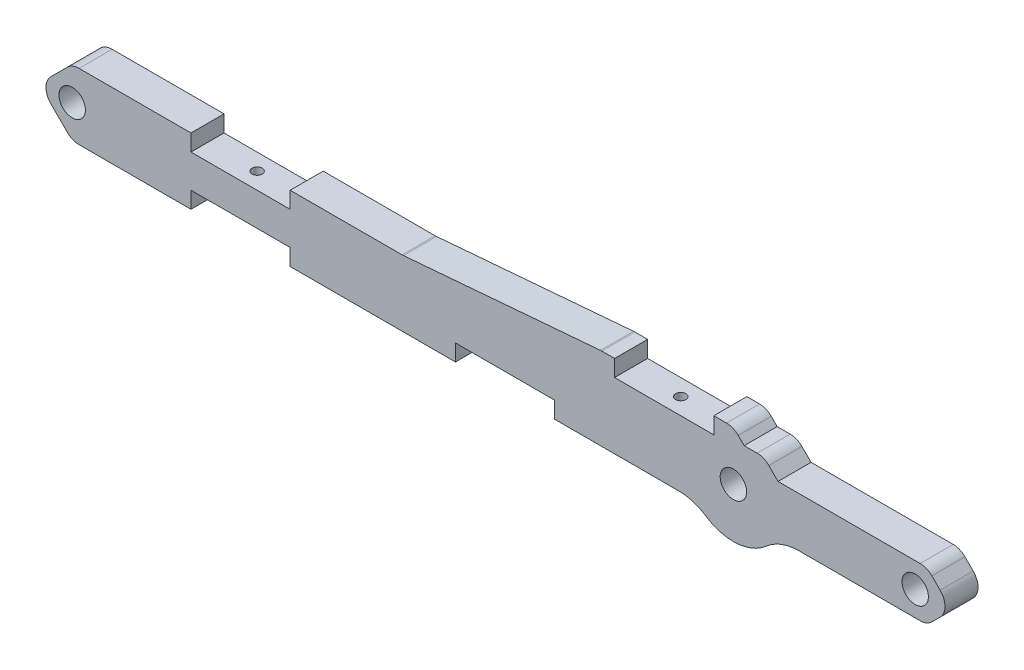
ISO-10303-21;
HEADER;
FILE_DESCRIPTION(('STEP AP214'),'2;1');
FILE_NAME('part.step','',(''),(''),'','','');
FILE_SCHEMA(('AUTOMOTIVE_DESIGN { 1 0 10303 214 1 1 1 1 }'));
ENDSEC;
DATA;
#1=APPLICATION_CONTEXT('core data for automotive mechanical design processes');
#2=APPLICATION_PROTOCOL_DEFINITION('international standard','automotive_design',2000,#1);
#3=PRODUCT_CONTEXT('',#1,'mechanical');
#4=PRODUCT('Part','Part','',(#3));
#5=PRODUCT_RELATED_PRODUCT_CATEGORY('part','',(#4));
#6=PRODUCT_DEFINITION_FORMATION('','',#4);
#7=PRODUCT_DEFINITION_CONTEXT('part definition',#1,'design');
#8=PRODUCT_DEFINITION('design','',#6,#7);
#9=PRODUCT_DEFINITION_SHAPE('','',#8);
#10=(LENGTH_UNIT() NAMED_UNIT(*) SI_UNIT(.MILLI.,.METRE.));
#11=(NAMED_UNIT(*) PLANE_ANGLE_UNIT() SI_UNIT($,.RADIAN.));
#12=(NAMED_UNIT(*) SI_UNIT($,.STERADIAN.) SOLID_ANGLE_UNIT());
#13=UNCERTAINTY_MEASURE_WITH_UNIT(LENGTH_MEASURE(1.E-05),#10,'distance_accuracy_value','');
#14=(GEOMETRIC_REPRESENTATION_CONTEXT(3) GLOBAL_UNCERTAINTY_ASSIGNED_CONTEXT((#13)) GLOBAL_UNIT_ASSIGNED_CONTEXT((#10,
#11,#12)) REPRESENTATION_CONTEXT('',''));
#15=CARTESIAN_POINT('',(0.,0.,0.));
#16=DIRECTION('',(0.,0.,1.));
#17=DIRECTION('',(1.,0.,0.));
#18=AXIS2_PLACEMENT_3D('',#15,#16,#17);
#19=CARTESIAN_POINT('',(-200.,-10.,5.));
#20=DIRECTION('',(0.,1.,0.));
#21=DIRECTION('',(-1.,0.,0.));
#22=AXIS2_PLACEMENT_3D('',#19,#20,#21);
#23=PLANE('',#22);
#24=DIRECTION('',(1.,0.,0.));
#25=VECTOR('',#24,1.);
#26=CARTESIAN_POINT('',(-200.,-10.,5.));
#27=LINE('',#26,#25);
#28=CARTESIAN_POINT('',(-134.068452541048,-10.,5.));
#29=VERTEX_POINT('',#28);
#30=CARTESIAN_POINT('',(-84.068452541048,-10.,5.));
#31=VERTEX_POINT('',#30);
#32=EDGE_CURVE('E499',#29,#31,#27,.T.);
#33=ORIENTED_EDGE('',*,*,#32,.F.);
#34=DIRECTION('',(0.,0.,1.));
#35=VECTOR('',#34,1.);
#36=CARTESIAN_POINT('',(-134.068452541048,-10.,-5.00000000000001));
#37=LINE('',#36,#35);
#38=CARTESIAN_POINT('',(-134.068452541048,-10.,-5.00000000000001));
#39=VERTEX_POINT('',#38);
#40=EDGE_CURVE('E325',#39,#29,#37,.T.);
#41=ORIENTED_EDGE('',*,*,#40,.F.);
#42=DIRECTION('',(1.,0.,0.));
#43=VECTOR('',#42,1.);
#44=CARTESIAN_POINT('',(-200.,-10.,-5.));
#45=LINE('',#44,#43);
#46=CARTESIAN_POINT('',(-84.068452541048,-10.,-5.));
#47=VERTEX_POINT('',#46);
#48=EDGE_CURVE('E564',#39,#47,#45,.T.);
#49=ORIENTED_EDGE('',*,*,#48,.T.);
#50=DIRECTION('',(0.,0.,-1.));
#51=VECTOR('',#50,1.);
#52=CARTESIAN_POINT('',(-84.068452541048,-10.,5.));
#53=LINE('',#52,#51);
#54=EDGE_CURVE('E360',#31,#47,#53,.T.);
#55=ORIENTED_EDGE('',*,*,#54,.F.);
#56=EDGE_LOOP('',(#33,#41,#49,#55));
#57=FACE_BOUND('',#56,.T.);
#58=ADVANCED_FACE('F39',(#57),#23,.F.);
#59=CARTESIAN_POINT('',(-197.928932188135,-10.,-5.));
#60=VERTEX_POINT('',#59);
#61=CARTESIAN_POINT('',(-164.068452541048,-10.,-5.00000000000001));
#62=VERTEX_POINT('',#61);
#63=EDGE_CURVE('E559',#60,#62,#45,.T.);
#64=ORIENTED_EDGE('',*,*,#63,.T.);
#65=DIRECTION('',(0.,0.,-1.));
#66=VECTOR('',#65,1.);
#67=CARTESIAN_POINT('',(-164.068452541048,-10.,5.));
#68=LINE('',#67,#66);
#69=CARTESIAN_POINT('',(-164.068452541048,-10.,5.));
#70=VERTEX_POINT('',#69);
#71=EDGE_CURVE('E364',#70,#62,#68,.T.);
#72=ORIENTED_EDGE('',*,*,#71,.F.);
#73=CARTESIAN_POINT('',(-197.928932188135,-10.,5.));
#74=VERTEX_POINT('',#73);
#75=EDGE_CURVE('E331',#74,#70,#27,.T.);
#76=ORIENTED_EDGE('',*,*,#75,.F.);
#77=DIRECTION('',(0.,0.,-1.));
#78=VECTOR('',#77,1.);
#79=CARTESIAN_POINT('',(-197.928932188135,-10.,5.));
#80=LINE('',#79,#78);
#81=EDGE_CURVE('E636',#74,#60,#80,.T.);
#82=ORIENTED_EDGE('',*,*,#81,.T.);
#83=EDGE_LOOP('',(#64,#72,#76,#82));
#84=FACE_BOUND('',#83,.T.);
#85=ADVANCED_FACE('F1019',(#84),#23,.F.);
#86=CARTESIAN_POINT('',(-100.,10.,5.));
#87=DIRECTION('',(0.,-1.,0.));
#88=DIRECTION('',(0.,0.,-1.));
#89=AXIS2_PLACEMENT_3D('',#86,#87,#88);
#90=PLANE('',#89);
#91=DIRECTION('',(-1.,0.,0.));
#92=VECTOR('',#91,1.);
#93=CARTESIAN_POINT('',(-100.,10.,-5.));
#94=LINE('',#93,#92);
#95=CARTESIAN_POINT('',(-100.207972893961,10.,-5.));
#96=VERTEX_POINT('',#95);
#97=CARTESIAN_POINT('',(-134.068452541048,10.,-5.00000000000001));
#98=VERTEX_POINT('',#97);
#99=EDGE_CURVE('E546',#96,#98,#94,.T.);
#100=ORIENTED_EDGE('',*,*,#99,.T.);
#101=DIRECTION('',(0.,0.,-1.));
#102=VECTOR('',#101,1.);
#103=CARTESIAN_POINT('',(-134.068452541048,10.,-5.00000000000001));
#104=LINE('',#103,#102);
#105=CARTESIAN_POINT('',(-134.068452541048,10.,5.));
#106=VERTEX_POINT('',#105);
#107=EDGE_CURVE('E397',#106,#98,#104,.T.);
#108=ORIENTED_EDGE('',*,*,#107,.F.);
#109=DIRECTION('',(-1.,0.,0.));
#110=VECTOR('',#109,1.);
#111=CARTESIAN_POINT('',(-100.,10.,5.));
#112=LINE('',#111,#110);
#113=CARTESIAN_POINT('',(-100.207972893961,10.,5.));
#114=VERTEX_POINT('',#113);
#115=EDGE_CURVE('E483',#114,#106,#112,.T.);
#116=ORIENTED_EDGE('',*,*,#115,.F.);
#117=DIRECTION('',(0.,0.,-1.));
#118=VECTOR('',#117,1.);
#119=CARTESIAN_POINT('',(-100.207972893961,10.,-5.));
#120=LINE('',#119,#118);
#121=EDGE_CURVE('E740',#114,#96,#120,.T.);
#122=ORIENTED_EDGE('',*,*,#121,.T.);
#123=EDGE_LOOP('',(#100,#108,#116,#122));
#124=FACE_BOUND('',#123,.T.);
#125=ADVANCED_FACE('F771',(#124),#90,.F.);
#126=CARTESIAN_POINT('',(-40.,15.,5.));
#127=DIRECTION('',(0.,-1.,0.));
#128=DIRECTION('',(0.,0.,-1.));
#129=AXIS2_PLACEMENT_3D('',#126,#127,#128);
#130=PLANE('',#129);
#131=DIRECTION('',(-1.,0.,0.));
#132=VECTOR('',#131,1.);
#133=CARTESIAN_POINT('',(-40.,15.,-5.));
#134=LINE('',#133,#132);
#135=CARTESIAN_POINT('',(-2.07106781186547,15.,-5.));
#136=VERTEX_POINT('',#135);
#137=CARTESIAN_POINT('',(-5.93154745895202,15.,-5.00000000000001));
#138=VERTEX_POINT('',#137);
#139=EDGE_CURVE('E482',#136,#138,#134,.T.);
#140=ORIENTED_EDGE('',*,*,#139,.T.);
#141=DIRECTION('',(0.,0.,-1.));
#142=VECTOR('',#141,1.);
#143=CARTESIAN_POINT('',(-5.93154745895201,15.,4.99999999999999));
#144=LINE('',#143,#142);
#145=CARTESIAN_POINT('',(-5.93154745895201,15.,4.99999999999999));
#146=VERTEX_POINT('',#145);
#147=EDGE_CURVE('E406',#146,#138,#144,.T.);
#148=ORIENTED_EDGE('',*,*,#147,.F.);
#149=DIRECTION('',(-1.,0.,0.));
#150=VECTOR('',#149,1.);
#151=CARTESIAN_POINT('',(-40.,15.,5.));
#152=LINE('',#151,#150);
#153=CARTESIAN_POINT('',(-2.07106781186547,15.,5.));
#154=VERTEX_POINT('',#153);
#155=EDGE_CURVE('E537',#154,#146,#152,.T.);
#156=ORIENTED_EDGE('',*,*,#155,.F.);
#157=DIRECTION('',(0.,0.,-1.));
#158=VECTOR('',#157,1.);
#159=CARTESIAN_POINT('',(-2.07106781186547,15.,5.));
#160=LINE('',#159,#158);
#161=EDGE_CURVE('E722',#154,#136,#160,.T.);
#162=ORIENTED_EDGE('',*,*,#161,.T.);
#163=EDGE_LOOP('',(#140,#148,#156,#162));
#164=FACE_BOUND('',#163,.T.);
#165=ADVANCED_FACE('F1005',(#164),#130,.F.);
#166=CARTESIAN_POINT('',(-16.583123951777,-25.,5.));
#167=DIRECTION('',(0.,0.,-1.));
#168=DIRECTION('',(-1.,0.,0.));
#169=AXIS2_PLACEMENT_3D('',#166,#167,#168);
#170=PLANE('',#169);
#171=DIRECTION('',(-1.,0.,0.));
#172=VECTOR('',#171,1.);
#173=CARTESIAN_POINT('',(-134.068452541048,-5.,5.));
#174=LINE('',#173,#172);
#175=CARTESIAN_POINT('',(-134.068452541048,-5.,5.));
#176=VERTEX_POINT('',#175);
#177=CARTESIAN_POINT('',(-164.068452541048,-5.,5.));
#178=VERTEX_POINT('',#177);
#179=EDGE_CURVE('E315',#176,#178,#174,.T.);
#180=ORIENTED_EDGE('',*,*,#179,.F.);
#181=DIRECTION('',(0.,-1.,0.));
#182=VECTOR('',#181,1.);
#183=CARTESIAN_POINT('',(-134.068452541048,-5.,5.));
#184=LINE('',#183,#182);
#185=EDGE_CURVE('E400',#176,#29,#184,.T.);
#186=ORIENTED_EDGE('',*,*,#185,.T.);
#187=ORIENTED_EDGE('',*,*,#32,.T.);
#188=DIRECTION('',(0.,-1.,0.));
#189=VECTOR('',#188,1.);
#190=CARTESIAN_POINT('',(-84.068452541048,-5.00000000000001,5.));
#191=LINE('',#190,#189);
#192=CARTESIAN_POINT('',(-84.068452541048,-5.00000000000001,5.));
#193=VERTEX_POINT('',#192);
#194=EDGE_CURVE('E353',#193,#31,#191,.T.);
#195=ORIENTED_EDGE('',*,*,#194,.F.);
#196=DIRECTION('',(-1.,0.,0.));
#197=VECTOR('',#196,1.);
#198=CARTESIAN_POINT('',(-84.068452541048,-5.00000000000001,5.));
#199=LINE('',#198,#197);
#200=CARTESIAN_POINT('',(-54.068452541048,-5.00000000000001,5.));
#201=VERTEX_POINT('',#200);
#202=EDGE_CURVE('E346',#201,#193,#199,.T.);
#203=ORIENTED_EDGE('',*,*,#202,.F.);
#204=DIRECTION('',(0.,-1.,0.));
#205=VECTOR('',#204,1.);
#206=CARTESIAN_POINT('',(-54.068452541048,-5.00000000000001,5.));
#207=LINE('',#206,#205);
#208=CARTESIAN_POINT('',(-54.068452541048,-10.,5.));
#209=VERTEX_POINT('',#208);
#210=EDGE_CURVE('E349',#201,#209,#207,.T.);
#211=ORIENTED_EDGE('',*,*,#210,.T.);
#212=CARTESIAN_POINT('',(-16.583123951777,-10.,5.));
#213=VERTEX_POINT('',#212);
#214=EDGE_CURVE('E495',#209,#213,#27,.T.);
#215=ORIENTED_EDGE('',*,*,#214,.T.);
#216=CARTESIAN_POINT('',(-16.583123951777,-25.,5.));
#217=DIRECTION('',(0.,0.,-1.));
#218=DIRECTION('',(-1.,0.,0.));
#219=AXIS2_PLACEMENT_3D('',#216,#217,#218);
#220=CIRCLE('',#219,15.);
#221=CARTESIAN_POINT('',(-8.29156197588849,-12.5,5.));
#222=VERTEX_POINT('',#221);
#223=EDGE_CURVE('E498',#213,#222,#220,.T.);
#224=ORIENTED_EDGE('',*,*,#223,.T.);
#225=CARTESIAN_POINT('',(0.,0.,5.));
#226=DIRECTION('',(0.,0.,1.));
#227=DIRECTION('',(-1.,0.,0.));
#228=AXIS2_PLACEMENT_3D('',#225,#226,#227);
#229=CIRCLE('',#228,15.);
#230=CARTESIAN_POINT('',(9.92156741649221,-11.25,5.));
#231=VERTEX_POINT('',#230);
#232=EDGE_CURVE('E502',#222,#231,#229,.T.);
#233=ORIENTED_EDGE('',*,*,#232,.T.);
#234=CARTESIAN_POINT('',(19.8431348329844,-22.5,5.));
#235=DIRECTION('',(0.,0.,-1.));
#236=DIRECTION('',(-1.,0.,0.));
#237=AXIS2_PLACEMENT_3D('',#234,#235,#236);
#238=CIRCLE('',#237,15.);
#239=CARTESIAN_POINT('',(19.8431348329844,-7.5,5.));
#240=VERTEX_POINT('',#239);
#241=EDGE_CURVE('E505',#231,#240,#238,.T.);
#242=ORIENTED_EDGE('',*,*,#241,.T.);
#243=DIRECTION('',(1.,0.,0.));
#244=VECTOR('',#243,1.);
#245=CARTESIAN_POINT('',(19.8431348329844,-7.5,5.));
#246=LINE('',#245,#244);
#247=CARTESIAN_POINT('',(56.5,-7.5,5.));
#248=VERTEX_POINT('',#247);
#249=EDGE_CURVE('E508',#240,#248,#246,.T.);
#250=ORIENTED_EDGE('',*,*,#249,.T.);
#251=CARTESIAN_POINT('',(56.5,-2.5,5.));
#252=DIRECTION('',(0.,0.,-1.));
#253=DIRECTION('',(-1.,0.,0.));
#254=AXIS2_PLACEMENT_3D('',#251,#252,#253);
#255=CIRCLE('',#254,5.);
#256=CARTESIAN_POINT('',(60.0355339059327,-6.03553390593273,5.));
#257=VERTEX_POINT('',#256);
#258=EDGE_CURVE('E688',#248,#257,#255,.F.);
#259=ORIENTED_EDGE('',*,*,#258,.T.);
#260=DIRECTION('',(0.707106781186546,0.707106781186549,0.));
#261=VECTOR('',#260,1.);
#262=CARTESIAN_POINT('',(58.5710678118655,-7.5,5.));
#263=LINE('',#262,#261);
#264=CARTESIAN_POINT('',(62.5355339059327,-3.53553390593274,5.));
#265=VERTEX_POINT('',#264);
#266=EDGE_CURVE('E512',#257,#265,#263,.T.);
#267=ORIENTED_EDGE('',*,*,#266,.T.);
#268=CARTESIAN_POINT('',(59.,0.,5.));
#269=DIRECTION('',(0.,0.,1.));
#270=DIRECTION('',(-1.,0.,0.));
#271=AXIS2_PLACEMENT_3D('',#268,#269,#270);
#272=CIRCLE('',#271,5.);
#273=CARTESIAN_POINT('',(62.5355339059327,3.53553390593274,5.));
#274=VERTEX_POINT('',#273);
#275=EDGE_CURVE('E515',#265,#274,#272,.T.);
#276=ORIENTED_EDGE('',*,*,#275,.T.);
#277=DIRECTION('',(-0.707106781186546,0.707106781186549,0.));
#278=VECTOR('',#277,1.);
#279=CARTESIAN_POINT('',(58.5710678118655,7.5,5.));
#280=LINE('',#279,#278);
#281=CARTESIAN_POINT('',(60.0355339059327,6.03553390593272,5.));
#282=VERTEX_POINT('',#281);
#283=EDGE_CURVE('E518',#274,#282,#280,.T.);
#284=ORIENTED_EDGE('',*,*,#283,.T.);
#285=CARTESIAN_POINT('',(56.5,2.5,5.));
#286=DIRECTION('',(0.,0.,-1.));
#287=DIRECTION('',(-1.,0.,0.));
#288=AXIS2_PLACEMENT_3D('',#285,#286,#287);
#289=CIRCLE('',#288,5.);
#290=CARTESIAN_POINT('',(56.5,7.5,5.));
#291=VERTEX_POINT('',#290);
#292=EDGE_CURVE('E685',#282,#291,#289,.F.);
#293=ORIENTED_EDGE('',*,*,#292,.T.);
#294=DIRECTION('',(-1.,0.,0.));
#295=VECTOR('',#294,1.);
#296=CARTESIAN_POINT('',(13.5,7.5,5.));
#297=LINE('',#296,#295);
#298=CARTESIAN_POINT('',(13.5,7.5,5.));
#299=VERTEX_POINT('',#298);
#300=EDGE_CURVE('E522',#291,#299,#297,.T.);
#301=ORIENTED_EDGE('',*,*,#300,.T.);
#302=DIRECTION('',(-0.707106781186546,0.707106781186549,0.));
#303=VECTOR('',#302,1.);
#304=CARTESIAN_POINT('',(9.2573593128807,11.7426406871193,5.));
#305=LINE('',#304,#303);
#306=CARTESIAN_POINT('',(10.721825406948,10.278174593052,5.));
#307=VERTEX_POINT('',#306);
#308=EDGE_CURVE('E525',#299,#307,#305,.T.);
#309=ORIENTED_EDGE('',*,*,#308,.T.);
#310=CARTESIAN_POINT('',(7.18629150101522,6.74264068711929,5.));
#311=DIRECTION('',(0.,0.,-1.));
#312=DIRECTION('',(-1.,0.,0.));
#313=AXIS2_PLACEMENT_3D('',#310,#311,#312);
#314=CIRCLE('',#313,5.);
#315=CARTESIAN_POINT('',(7.18629150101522,11.7426406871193,5.));
#316=VERTEX_POINT('',#315);
#317=EDGE_CURVE('E691',#307,#316,#314,.F.);
#318=ORIENTED_EDGE('',*,*,#317,.T.);
#319=DIRECTION('',(-1.,0.,0.));
#320=VECTOR('',#319,1.);
#321=CARTESIAN_POINT('',(3.2573593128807,11.7426406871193,5.));
#322=LINE('',#321,#320);
#323=CARTESIAN_POINT('',(3.2573593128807,11.7426406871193,5.));
#324=VERTEX_POINT('',#323);
#325=EDGE_CURVE('E529',#316,#324,#322,.T.);
#326=ORIENTED_EDGE('',*,*,#325,.T.);
#327=DIRECTION('',(-0.707106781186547,0.707106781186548,0.));
#328=VECTOR('',#327,1.);
#329=CARTESIAN_POINT('',(0.,15.,5.));
#330=LINE('',#329,#328);
#331=CARTESIAN_POINT('',(1.46446609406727,13.5355339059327,5.));
#332=VERTEX_POINT('',#331);
#333=EDGE_CURVE('E532',#324,#332,#330,.T.);
#334=ORIENTED_EDGE('',*,*,#333,.T.);
#335=CARTESIAN_POINT('',(-2.07106781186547,10.,5.));
#336=DIRECTION('',(0.,0.,-1.));
#337=DIRECTION('',(-1.,0.,0.));
#338=AXIS2_PLACEMENT_3D('',#335,#336,#337);
#339=CIRCLE('',#338,5.);
#340=EDGE_CURVE('E682',#332,#154,#339,.F.);
#341=ORIENTED_EDGE('',*,*,#340,.T.);
#342=ORIENTED_EDGE('',*,*,#155,.T.);
#343=DIRECTION('',(0.,1.,0.));
#344=VECTOR('',#343,1.);
#345=CARTESIAN_POINT('',(-5.93154745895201,10.,4.99999999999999));
#346=LINE('',#345,#344);
#347=CARTESIAN_POINT('',(-5.93154745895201,10.,4.99999999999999));
#348=VERTEX_POINT('',#347);
#349=EDGE_CURVE('E439',#348,#146,#346,.T.);
#350=ORIENTED_EDGE('',*,*,#349,.F.);
#351=DIRECTION('',(1.,0.,0.));
#352=VECTOR('',#351,1.);
#353=CARTESIAN_POINT('',(-5.93154745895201,10.,4.99999999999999));
#354=LINE('',#353,#352);
#355=CARTESIAN_POINT('',(-35.931547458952,10.,5.));
#356=VERTEX_POINT('',#355);
#357=EDGE_CURVE('E430',#356,#348,#354,.T.);
#358=ORIENTED_EDGE('',*,*,#357,.F.);
#359=DIRECTION('',(0.,1.,0.));
#360=VECTOR('',#359,1.);
#361=CARTESIAN_POINT('',(-35.931547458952,10.,5.));
#362=LINE('',#361,#360);
#363=CARTESIAN_POINT('',(-35.931547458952,15.,5.));
#364=VERTEX_POINT('',#363);
#365=EDGE_CURVE('E443',#356,#364,#362,.T.);
#366=ORIENTED_EDGE('',*,*,#365,.T.);
#367=CARTESIAN_POINT('',(-39.7920271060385,15.,5.));
#368=VERTEX_POINT('',#367);
#369=EDGE_CURVE('E536',#364,#368,#152,.T.);
#370=ORIENTED_EDGE('',*,*,#369,.T.);
#371=CARTESIAN_POINT('',(-39.7920271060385,10.,5.));
#372=DIRECTION('',(0.,0.,-1.));
#373=DIRECTION('',(-1.,0.,0.));
#374=AXIS2_PLACEMENT_3D('',#371,#372,#373);
#375=CIRCLE('',#374,5.);
#376=CARTESIAN_POINT('',(-40.2072545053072,14.9827287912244,5.));
#377=VERTEX_POINT('',#376);
#378=EDGE_CURVE('E679',#368,#377,#375,.F.);
#379=ORIENTED_EDGE('',*,*,#378,.T.);
#380=DIRECTION('',(-0.99654575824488,-0.0830454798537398,0.));
#381=VECTOR('',#380,1.);
#382=CARTESIAN_POINT('',(-40.,15.,5.));
#383=LINE('',#382,#381);
#384=CARTESIAN_POINT('',(-99.7927454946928,10.0172712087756,5.));
#385=VERTEX_POINT('',#384);
#386=EDGE_CURVE('E477',#377,#385,#383,.T.);
#387=ORIENTED_EDGE('',*,*,#386,.T.);
#388=CARTESIAN_POINT('',(-100.207972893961,15.,5.));
#389=DIRECTION('',(0.,0.,-1.));
#390=DIRECTION('',(-1.,0.,0.));
#391=AXIS2_PLACEMENT_3D('',#388,#389,#390);
#392=CIRCLE('',#391,5.);
#393=EDGE_CURVE('E11',#385,#114,#392,.T.);
#394=ORIENTED_EDGE('',*,*,#393,.T.);
#395=ORIENTED_EDGE('',*,*,#115,.T.);
#396=DIRECTION('',(0.,1.,0.));
#397=VECTOR('',#396,1.);
#398=CARTESIAN_POINT('',(-134.068452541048,5.,5.));
#399=LINE('',#398,#397);
#400=CARTESIAN_POINT('',(-134.068452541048,5.,5.));
#401=VERTEX_POINT('',#400);
#402=EDGE_CURVE('E403',#401,#106,#399,.T.);
#403=ORIENTED_EDGE('',*,*,#402,.F.);
#404=DIRECTION('',(1.,0.,0.));
#405=VECTOR('',#404,1.);
#406=CARTESIAN_POINT('',(-134.068452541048,5.,5.));
#407=LINE('',#406,#405);
#408=CARTESIAN_POINT('',(-164.068452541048,4.99999999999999,5.));
#409=VERTEX_POINT('',#408);
#410=EDGE_CURVE('E392',#409,#401,#407,.T.);
#411=ORIENTED_EDGE('',*,*,#410,.F.);
#412=DIRECTION('',(0.,1.,0.));
#413=VECTOR('',#412,1.);
#414=CARTESIAN_POINT('',(-164.068452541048,4.99999999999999,5.));
#415=LINE('',#414,#413);
#416=CARTESIAN_POINT('',(-164.068452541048,9.99999999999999,5.));
#417=VERTEX_POINT('',#416);
#418=EDGE_CURVE('E407',#409,#417,#415,.T.);
#419=ORIENTED_EDGE('',*,*,#418,.T.);
#420=CARTESIAN_POINT('',(-197.928932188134,10.,5.));
#421=VERTEX_POINT('',#420);
#422=EDGE_CURVE('E481',#417,#421,#112,.T.);
#423=ORIENTED_EDGE('',*,*,#422,.T.);
#424=CARTESIAN_POINT('',(-197.928932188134,5.00000000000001,5.));
#425=DIRECTION('',(0.,0.,-1.));
#426=DIRECTION('',(-1.,0.,0.));
#427=AXIS2_PLACEMENT_3D('',#424,#425,#426);
#428=CIRCLE('',#427,5.);
#429=CARTESIAN_POINT('',(-201.464466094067,8.53553390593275,5.));
#430=VERTEX_POINT('',#429);
#431=EDGE_CURVE('E676',#421,#430,#428,.F.);
#432=ORIENTED_EDGE('',*,*,#431,.T.);
#433=DIRECTION('',(-0.707106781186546,-0.70710678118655,0.));
#434=VECTOR('',#433,1.);
#435=CARTESIAN_POINT('',(-200.,10.,5.));
#436=LINE('',#435,#434);
#437=CARTESIAN_POINT('',(-206.464466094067,3.53553390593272,5.));
#438=VERTEX_POINT('',#437);
#439=EDGE_CURVE('E487',#430,#438,#436,.T.);
#440=ORIENTED_EDGE('',*,*,#439,.T.);
#441=CARTESIAN_POINT('',(-202.928932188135,0.,5.));
#442=DIRECTION('',(0.,0.,-1.));
#443=DIRECTION('',(-1.,0.,0.));
#444=AXIS2_PLACEMENT_3D('',#441,#442,#443);
#445=CIRCLE('',#444,5.);
#446=CARTESIAN_POINT('',(-206.464466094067,-3.53553390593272,5.));
#447=VERTEX_POINT('',#446);
#448=EDGE_CURVE('E673',#438,#447,#445,.F.);
#449=ORIENTED_EDGE('',*,*,#448,.T.);
#450=DIRECTION('',(0.707106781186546,-0.707106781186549,0.));
#451=VECTOR('',#450,1.);
#452=CARTESIAN_POINT('',(-210.,0.,5.));
#453=LINE('',#452,#451);
#454=CARTESIAN_POINT('',(-201.464466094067,-8.53553390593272,5.));
#455=VERTEX_POINT('',#454);
#456=EDGE_CURVE('E491',#447,#455,#453,.T.);
#457=ORIENTED_EDGE('',*,*,#456,.T.);
#458=CARTESIAN_POINT('',(-197.928932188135,-5.,5.));
#459=DIRECTION('',(0.,0.,-1.));
#460=DIRECTION('',(-1.,0.,0.));
#461=AXIS2_PLACEMENT_3D('',#458,#459,#460);
#462=CIRCLE('',#461,5.);
#463=EDGE_CURVE('E694',#455,#74,#462,.F.);
#464=ORIENTED_EDGE('',*,*,#463,.T.);
#465=ORIENTED_EDGE('',*,*,#75,.T.);
#466=DIRECTION('',(0.,-1.,0.));
#467=VECTOR('',#466,1.);
#468=CARTESIAN_POINT('',(-164.068452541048,-5.,5.));
#469=LINE('',#468,#467);
#470=EDGE_CURVE('E63',#178,#70,#469,.T.);
#471=ORIENTED_EDGE('',*,*,#470,.F.);
#472=EDGE_LOOP('',(#180,#186,#187,#195,#203,#211,#215,#224,#233,#242,#250,#259,#267,#276,#284,
#293,#301,#309,#318,#326,#334,#341,#342,#350,#358,#366,#370,#379,#387,#394,#395,#403,#411,#419,
#423,#432,#440,#449,#457,#464,#465,#471));
#473=FACE_BOUND('',#472,.T.);
#474=CARTESIAN_POINT('',(0.,0.,5.));
#475=DIRECTION('',(0.,0.,1.));
#476=DIRECTION('',(1.,0.,0.));
#477=AXIS2_PLACEMENT_3D('',#474,#475,#476);
#478=CIRCLE('',#477,4.);
#479=CARTESIAN_POINT('',(4.,0.,5.));
#480=VERTEX_POINT('',#479);
#481=EDGE_CURVE('E469',#480,#480,#478,.T.);
#482=ORIENTED_EDGE('',*,*,#481,.F.);
#483=EDGE_LOOP('',(#482));
#484=FACE_BOUND('',#483,.T.);
#485=CARTESIAN_POINT('',(55.,0.,5.));
#486=DIRECTION('',(0.,0.,1.));
#487=DIRECTION('',(1.,0.,0.));
#488=AXIS2_PLACEMENT_3D('',#485,#486,#487);
#489=CIRCLE('',#488,4.);
#490=CARTESIAN_POINT('',(59.,0.,5.));
#491=VERTEX_POINT('',#490);
#492=EDGE_CURVE('E461',#491,#491,#489,.T.);
#493=ORIENTED_EDGE('',*,*,#492,.F.);
#494=EDGE_LOOP('',(#493));
#495=FACE_BOUND('',#494,.T.);
#496=CARTESIAN_POINT('',(-200.,0.,5.));
#497=DIRECTION('',(0.,0.,1.));
#498=DIRECTION('',(1.,0.,0.));
#499=AXIS2_PLACEMENT_3D('',#496,#497,#498);
#500=CIRCLE('',#499,3.99999999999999);
#501=CARTESIAN_POINT('',(-196.,0.,5.));
#502=VERTEX_POINT('',#501);
#503=EDGE_CURVE('E453',#502,#502,#500,.T.);
#504=ORIENTED_EDGE('',*,*,#503,.F.);
#505=EDGE_LOOP('',(#504));
#506=FACE_BOUND('',#505,.T.);
#507=ADVANCED_FACE('F328',(#473,#484,#495,#506),#170,.F.);
#508=CARTESIAN_POINT('',(-16.583123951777,-25.,-5.));
#509=DIRECTION('',(0.,0.,-1.));
#510=DIRECTION('',(-1.,0.,0.));
#511=AXIS2_PLACEMENT_3D('',#508,#509,#510);
#512=PLANE('',#511);
#513=DIRECTION('',(0.,-1.,0.));
#514=VECTOR('',#513,1.);
#515=CARTESIAN_POINT('',(-134.068452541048,-5.,-5.00000000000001));
#516=LINE('',#515,#514);
#517=CARTESIAN_POINT('',(-134.068452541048,-5.,-5.00000000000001));
#518=VERTEX_POINT('',#517);
#519=EDGE_CURVE('E337',#518,#39,#516,.T.);
#520=ORIENTED_EDGE('',*,*,#519,.F.);
#521=DIRECTION('',(1.,0.,0.));
#522=VECTOR('',#521,1.);
#523=CARTESIAN_POINT('',(-164.068452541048,-5.,-5.00000000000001));
#524=LINE('',#523,#522);
#525=CARTESIAN_POINT('',(-164.068452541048,-5.,-5.00000000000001));
#526=VERTEX_POINT('',#525);
#527=EDGE_CURVE('E314',#526,#518,#524,.T.);
#528=ORIENTED_EDGE('',*,*,#527,.F.);
#529=DIRECTION('',(0.,-1.,0.));
#530=VECTOR('',#529,1.);
#531=CARTESIAN_POINT('',(-164.068452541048,-5.,-5.00000000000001));
#532=LINE('',#531,#530);
#533=EDGE_CURVE('E310',#526,#62,#532,.T.);
#534=ORIENTED_EDGE('',*,*,#533,.T.);
#535=ORIENTED_EDGE('',*,*,#63,.F.);
#536=CARTESIAN_POINT('',(-197.928932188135,-5.,-5.));
#537=DIRECTION('',(0.,0.,-1.));
#538=DIRECTION('',(-1.,0.,0.));
#539=AXIS2_PLACEMENT_3D('',#536,#537,#538);
#540=CIRCLE('',#539,5.);
#541=CARTESIAN_POINT('',(-201.464466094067,-8.53553390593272,-5.));
#542=VERTEX_POINT('',#541);
#543=EDGE_CURVE('E663',#60,#542,#540,.T.);
#544=ORIENTED_EDGE('',*,*,#543,.T.);
#545=DIRECTION('',(0.707106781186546,-0.707106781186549,0.));
#546=VECTOR('',#545,1.);
#547=CARTESIAN_POINT('',(-210.,0.,-5.));
#548=LINE('',#547,#546);
#549=CARTESIAN_POINT('',(-206.464466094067,-3.53553390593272,-5.));
#550=VERTEX_POINT('',#549);
#551=EDGE_CURVE('E554',#550,#542,#548,.T.);
#552=ORIENTED_EDGE('',*,*,#551,.F.);
#553=CARTESIAN_POINT('',(-202.928932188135,0.,-5.));
#554=DIRECTION('',(0.,0.,-1.));
#555=DIRECTION('',(-1.,0.,0.));
#556=AXIS2_PLACEMENT_3D('',#553,#554,#555);
#557=CIRCLE('',#556,5.);
#558=CARTESIAN_POINT('',(-206.464466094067,3.53553390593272,-5.));
#559=VERTEX_POINT('',#558);
#560=EDGE_CURVE('E640',#550,#559,#557,.T.);
#561=ORIENTED_EDGE('',*,*,#560,.T.);
#562=DIRECTION('',(-0.707106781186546,-0.70710678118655,0.));
#563=VECTOR('',#562,1.);
#564=CARTESIAN_POINT('',(-200.,10.,-5.));
#565=LINE('',#564,#563);
#566=CARTESIAN_POINT('',(-201.464466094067,8.53553390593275,-5.));
#567=VERTEX_POINT('',#566);
#568=EDGE_CURVE('E550',#567,#559,#565,.T.);
#569=ORIENTED_EDGE('',*,*,#568,.F.);
#570=CARTESIAN_POINT('',(-197.928932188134,5.00000000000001,-5.));
#571=DIRECTION('',(0.,0.,-1.));
#572=DIRECTION('',(-1.,0.,0.));
#573=AXIS2_PLACEMENT_3D('',#570,#571,#572);
#574=CIRCLE('',#573,5.);
#575=CARTESIAN_POINT('',(-197.928932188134,10.,-5.));
#576=VERTEX_POINT('',#575);
#577=EDGE_CURVE('E643',#567,#576,#574,.T.);
#578=ORIENTED_EDGE('',*,*,#577,.T.);
#579=CARTESIAN_POINT('',(-164.068452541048,10.,-5.));
#580=VERTEX_POINT('',#579);
#581=EDGE_CURVE('E545',#580,#576,#94,.T.);
#582=ORIENTED_EDGE('',*,*,#581,.F.);
#583=DIRECTION('',(0.,1.,0.));
#584=VECTOR('',#583,1.);
#585=CARTESIAN_POINT('',(-164.068452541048,4.99999999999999,-5.00000000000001));
#586=LINE('',#585,#584);
#587=CARTESIAN_POINT('',(-164.068452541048,4.99999999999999,-5.00000000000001));
#588=VERTEX_POINT('',#587);
#589=EDGE_CURVE('E411',#588,#580,#586,.T.);
#590=ORIENTED_EDGE('',*,*,#589,.F.);
#591=DIRECTION('',(-1.,0.,0.));
#592=VECTOR('',#591,1.);
#593=CARTESIAN_POINT('',(-134.068452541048,5.,-5.00000000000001));
#594=LINE('',#593,#592);
#595=CARTESIAN_POINT('',(-134.068452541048,5.,-5.00000000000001));
#596=VERTEX_POINT('',#595);
#597=EDGE_CURVE('E383',#596,#588,#594,.T.);
#598=ORIENTED_EDGE('',*,*,#597,.F.);
#599=DIRECTION('',(0.,1.,0.));
#600=VECTOR('',#599,1.);
#601=CARTESIAN_POINT('',(-134.068452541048,5.,-5.00000000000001));
#602=LINE('',#601,#600);
#603=EDGE_CURVE('E396',#596,#98,#602,.T.);
#604=ORIENTED_EDGE('',*,*,#603,.T.);
#605=ORIENTED_EDGE('',*,*,#99,.F.);
#606=CARTESIAN_POINT('',(-100.207972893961,15.,-5.));
#607=DIRECTION('',(0.,0.,-1.));
#608=DIRECTION('',(-1.,0.,0.));
#609=AXIS2_PLACEMENT_3D('',#606,#607,#608);
#610=CIRCLE('',#609,5.);
#611=CARTESIAN_POINT('',(-99.7927454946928,10.0172712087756,-5.));
#612=VERTEX_POINT('',#611);
#613=EDGE_CURVE('E48',#96,#612,#610,.F.);
#614=ORIENTED_EDGE('',*,*,#613,.T.);
#615=DIRECTION('',(-0.99654575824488,-0.0830454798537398,0.));
#616=VECTOR('',#615,1.);
#617=CARTESIAN_POINT('',(-40.,15.,-5.));
#618=LINE('',#617,#616);
#619=CARTESIAN_POINT('',(-40.2072545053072,14.9827287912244,-5.));
#620=VERTEX_POINT('',#619);
#621=EDGE_CURVE('E473',#620,#612,#618,.T.);
#622=ORIENTED_EDGE('',*,*,#621,.F.);
#623=CARTESIAN_POINT('',(-39.7920271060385,10.,-5.));
#624=DIRECTION('',(0.,0.,-1.));
#625=DIRECTION('',(-1.,0.,0.));
#626=AXIS2_PLACEMENT_3D('',#623,#624,#625);
#627=CIRCLE('',#626,5.);
#628=CARTESIAN_POINT('',(-39.7920271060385,15.,-5.));
#629=VERTEX_POINT('',#628);
#630=EDGE_CURVE('E647',#620,#629,#627,.T.);
#631=ORIENTED_EDGE('',*,*,#630,.T.);
#632=CARTESIAN_POINT('',(-35.931547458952,15.,-5.));
#633=VERTEX_POINT('',#632);
#634=EDGE_CURVE('E601',#633,#629,#134,.T.);
#635=ORIENTED_EDGE('',*,*,#634,.F.);
#636=DIRECTION('',(0.,1.,0.));
#637=VECTOR('',#636,1.);
#638=CARTESIAN_POINT('',(-35.931547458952,10.,-5.));
#639=LINE('',#638,#637);
#640=CARTESIAN_POINT('',(-35.931547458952,10.,-5.));
#641=VERTEX_POINT('',#640);
#642=EDGE_CURVE('E447',#641,#633,#639,.T.);
#643=ORIENTED_EDGE('',*,*,#642,.F.);
#644=DIRECTION('',(-1.,0.,0.));
#645=VECTOR('',#644,1.);
#646=CARTESIAN_POINT('',(-5.93154745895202,10.,-5.00000000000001));
#647=LINE('',#646,#645);
#648=CARTESIAN_POINT('',(-5.93154745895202,10.,-5.00000000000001));
#649=VERTEX_POINT('',#648);
#650=EDGE_CURVE('E421',#649,#641,#647,.T.);
#651=ORIENTED_EDGE('',*,*,#650,.F.);
#652=DIRECTION('',(0.,1.,0.));
#653=VECTOR('',#652,1.);
#654=CARTESIAN_POINT('',(-5.93154745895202,10.,-5.00000000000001));
#655=LINE('',#654,#653);
#656=EDGE_CURVE('E434',#649,#138,#655,.T.);
#657=ORIENTED_EDGE('',*,*,#656,.T.);
#658=ORIENTED_EDGE('',*,*,#139,.F.);
#659=CARTESIAN_POINT('',(-2.07106781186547,10.,-5.));
#660=DIRECTION('',(0.,0.,-1.));
#661=DIRECTION('',(-1.,0.,0.));
#662=AXIS2_PLACEMENT_3D('',#659,#660,#661);
#663=CIRCLE('',#662,5.);
#664=CARTESIAN_POINT('',(1.46446609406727,13.5355339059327,-5.));
#665=VERTEX_POINT('',#664);
#666=EDGE_CURVE('E651',#136,#665,#663,.T.);
#667=ORIENTED_EDGE('',*,*,#666,.T.);
#668=DIRECTION('',(-0.707106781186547,0.707106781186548,0.));
#669=VECTOR('',#668,1.);
#670=CARTESIAN_POINT('',(0.,15.,-5.));
#671=LINE('',#670,#669);
#672=CARTESIAN_POINT('',(3.2573593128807,11.7426406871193,-5.));
#673=VERTEX_POINT('',#672);
#674=EDGE_CURVE('E597',#673,#665,#671,.T.);
#675=ORIENTED_EDGE('',*,*,#674,.F.);
#676=DIRECTION('',(-1.,0.,0.));
#677=VECTOR('',#676,1.);
#678=CARTESIAN_POINT('',(3.2573593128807,11.7426406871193,-5.));
#679=LINE('',#678,#677);
#680=CARTESIAN_POINT('',(7.18629150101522,11.7426406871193,-5.));
#681=VERTEX_POINT('',#680);
#682=EDGE_CURVE('E594',#681,#673,#679,.T.);
#683=ORIENTED_EDGE('',*,*,#682,.F.);
#684=CARTESIAN_POINT('',(7.18629150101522,6.74264068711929,-5.));
#685=DIRECTION('',(0.,0.,-1.));
#686=DIRECTION('',(-1.,0.,0.));
#687=AXIS2_PLACEMENT_3D('',#684,#685,#686);
#688=CIRCLE('',#687,5.);
#689=CARTESIAN_POINT('',(10.721825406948,10.278174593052,-5.));
#690=VERTEX_POINT('',#689);
#691=EDGE_CURVE('E660',#681,#690,#688,.T.);
#692=ORIENTED_EDGE('',*,*,#691,.T.);
#693=DIRECTION('',(-0.707106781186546,0.707106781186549,0.));
#694=VECTOR('',#693,1.);
#695=CARTESIAN_POINT('',(9.2573593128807,11.7426406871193,-5.));
#696=LINE('',#695,#694);
#697=CARTESIAN_POINT('',(13.5,7.5,-5.));
#698=VERTEX_POINT('',#697);
#699=EDGE_CURVE('E590',#698,#690,#696,.T.);
#700=ORIENTED_EDGE('',*,*,#699,.F.);
#701=DIRECTION('',(-1.,0.,0.));
#702=VECTOR('',#701,1.);
#703=CARTESIAN_POINT('',(13.5,7.5,-5.));
#704=LINE('',#703,#702);
#705=CARTESIAN_POINT('',(56.5,7.5,-5.));
#706=VERTEX_POINT('',#705);
#707=EDGE_CURVE('E587',#706,#698,#704,.T.);
#708=ORIENTED_EDGE('',*,*,#707,.F.);
#709=CARTESIAN_POINT('',(56.5,2.5,-5.));
#710=DIRECTION('',(0.,0.,-1.));
#711=DIRECTION('',(-1.,0.,0.));
#712=AXIS2_PLACEMENT_3D('',#709,#710,#711);
#713=CIRCLE('',#712,5.);
#714=CARTESIAN_POINT('',(60.0355339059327,6.03553390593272,-5.));
#715=VERTEX_POINT('',#714);
#716=EDGE_CURVE('E654',#706,#715,#713,.T.);
#717=ORIENTED_EDGE('',*,*,#716,.T.);
#718=DIRECTION('',(-0.707106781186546,0.707106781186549,0.));
#719=VECTOR('',#718,1.);
#720=CARTESIAN_POINT('',(58.5710678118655,7.5,-5.));
#721=LINE('',#720,#719);
#722=CARTESIAN_POINT('',(62.5355339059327,3.53553390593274,-5.));
#723=VERTEX_POINT('',#722);
#724=EDGE_CURVE('E583',#723,#715,#721,.T.);
#725=ORIENTED_EDGE('',*,*,#724,.F.);
#726=CARTESIAN_POINT('',(59.,0.,-5.));
#727=DIRECTION('',(0.,0.,1.));
#728=DIRECTION('',(-1.,0.,0.));
#729=AXIS2_PLACEMENT_3D('',#726,#727,#728);
#730=CIRCLE('',#729,5.);
#731=CARTESIAN_POINT('',(62.5355339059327,-3.53553390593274,-5.));
#732=VERTEX_POINT('',#731);
#733=EDGE_CURVE('E580',#732,#723,#730,.T.);
#734=ORIENTED_EDGE('',*,*,#733,.F.);
#735=DIRECTION('',(0.707106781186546,0.707106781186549,0.));
#736=VECTOR('',#735,1.);
#737=CARTESIAN_POINT('',(58.5710678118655,-7.5,-5.));
#738=LINE('',#737,#736);
#739=CARTESIAN_POINT('',(60.0355339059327,-6.03553390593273,-5.));
#740=VERTEX_POINT('',#739);
#741=EDGE_CURVE('E577',#740,#732,#738,.T.);
#742=ORIENTED_EDGE('',*,*,#741,.F.);
#743=CARTESIAN_POINT('',(56.5,-2.5,-5.));
#744=DIRECTION('',(0.,0.,-1.));
#745=DIRECTION('',(-1.,0.,0.));
#746=AXIS2_PLACEMENT_3D('',#743,#744,#745);
#747=CIRCLE('',#746,5.);
#748=CARTESIAN_POINT('',(56.5,-7.5,-5.));
#749=VERTEX_POINT('',#748);
#750=EDGE_CURVE('E657',#740,#749,#747,.T.);
#751=ORIENTED_EDGE('',*,*,#750,.T.);
#752=DIRECTION('',(1.,0.,0.));
#753=VECTOR('',#752,1.);
#754=CARTESIAN_POINT('',(19.8431348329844,-7.5,-5.));
#755=LINE('',#754,#753);
#756=CARTESIAN_POINT('',(19.8431348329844,-7.5,-5.));
#757=VERTEX_POINT('',#756);
#758=EDGE_CURVE('E573',#757,#749,#755,.T.);
#759=ORIENTED_EDGE('',*,*,#758,.F.);
#760=CARTESIAN_POINT('',(19.8431348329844,-22.5,-5.));
#761=DIRECTION('',(0.,0.,-1.));
#762=DIRECTION('',(-1.,0.,0.));
#763=AXIS2_PLACEMENT_3D('',#760,#761,#762);
#764=CIRCLE('',#763,15.);
#765=CARTESIAN_POINT('',(9.92156741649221,-11.25,-5.));
#766=VERTEX_POINT('',#765);
#767=EDGE_CURVE('E570',#766,#757,#764,.T.);
#768=ORIENTED_EDGE('',*,*,#767,.F.);
#769=CARTESIAN_POINT('',(0.,0.,-5.));
#770=DIRECTION('',(0.,0.,1.));
#771=DIRECTION('',(-1.,0.,0.));
#772=AXIS2_PLACEMENT_3D('',#769,#770,#771);
#773=CIRCLE('',#772,15.);
#774=CARTESIAN_POINT('',(-8.29156197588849,-12.5,-5.));
#775=VERTEX_POINT('',#774);
#776=EDGE_CURVE('E567',#775,#766,#773,.T.);
#777=ORIENTED_EDGE('',*,*,#776,.F.);
#778=CARTESIAN_POINT('',(-16.583123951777,-25.,-5.));
#779=DIRECTION('',(0.,0.,-1.));
#780=DIRECTION('',(-1.,0.,0.));
#781=AXIS2_PLACEMENT_3D('',#778,#779,#780);
#782=CIRCLE('',#781,15.);
#783=CARTESIAN_POINT('',(-16.583123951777,-10.,-5.));
#784=VERTEX_POINT('',#783);
#785=EDGE_CURVE('E563',#784,#775,#782,.T.);
#786=ORIENTED_EDGE('',*,*,#785,.F.);
#787=CARTESIAN_POINT('',(-54.068452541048,-10.,-5.));
#788=VERTEX_POINT('',#787);
#789=EDGE_CURVE('E558',#788,#784,#45,.T.);
#790=ORIENTED_EDGE('',*,*,#789,.F.);
#791=DIRECTION('',(0.,-1.,0.));
#792=VECTOR('',#791,1.);
#793=CARTESIAN_POINT('',(-54.068452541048,-5.00000000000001,-5.));
#794=LINE('',#793,#792);
#795=CARTESIAN_POINT('',(-54.068452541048,-5.00000000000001,-5.));
#796=VERTEX_POINT('',#795);
#797=EDGE_CURVE('E55',#796,#788,#794,.T.);
#798=ORIENTED_EDGE('',*,*,#797,.F.);
#799=DIRECTION('',(1.,0.,0.));
#800=VECTOR('',#799,1.);
#801=CARTESIAN_POINT('',(-84.068452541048,-5.00000000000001,-5.));
#802=LINE('',#801,#800);
#803=CARTESIAN_POINT('',(-84.068452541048,-5.00000000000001,-5.));
#804=VERTEX_POINT('',#803);
#805=EDGE_CURVE('E372',#804,#796,#802,.T.);
#806=ORIENTED_EDGE('',*,*,#805,.F.);
#807=DIRECTION('',(0.,-1.,0.));
#808=VECTOR('',#807,1.);
#809=CARTESIAN_POINT('',(-84.068452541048,-5.00000000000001,-5.));
#810=LINE('',#809,#808);
#811=EDGE_CURVE('E342',#804,#47,#810,.T.);
#812=ORIENTED_EDGE('',*,*,#811,.T.);
#813=ORIENTED_EDGE('',*,*,#48,.F.);
#814=EDGE_LOOP('',(#520,#528,#534,#535,#544,#552,#561,#569,#578,#582,#590,#598,#604,#605,#614,
#622,#631,#635,#643,#651,#657,#658,#667,#675,#683,#692,#700,#708,#717,#725,#734,#742,#751,#759,
#768,#777,#786,#790,#798,#806,#812,#813));
#815=FACE_BOUND('',#814,.T.);
#816=CARTESIAN_POINT('',(55.,0.,-5.));
#817=DIRECTION('',(0.,0.,1.));
#818=DIRECTION('',(1.,0.,0.));
#819=AXIS2_PLACEMENT_3D('',#816,#817,#818);
#820=CIRCLE('',#819,4.);
#821=CARTESIAN_POINT('',(59.,0.,-5.));
#822=VERTEX_POINT('',#821);
#823=EDGE_CURVE('E457',#822,#822,#820,.T.);
#824=ORIENTED_EDGE('',*,*,#823,.T.);
#825=EDGE_LOOP('',(#824));
#826=FACE_BOUND('',#825,.T.);
#827=CARTESIAN_POINT('',(0.,0.,-5.));
#828=DIRECTION('',(0.,0.,1.));
#829=DIRECTION('',(1.,0.,0.));
#830=AXIS2_PLACEMENT_3D('',#827,#828,#829);
#831=CIRCLE('',#830,4.);
#832=CARTESIAN_POINT('',(4.,0.,-5.));
#833=VERTEX_POINT('',#832);
#834=EDGE_CURVE('E465',#833,#833,#831,.T.);
#835=ORIENTED_EDGE('',*,*,#834,.T.);
#836=EDGE_LOOP('',(#835));
#837=FACE_BOUND('',#836,.T.);
#838=CARTESIAN_POINT('',(-200.,0.,-5.));
#839=DIRECTION('',(0.,0.,1.));
#840=DIRECTION('',(1.,0.,0.));
#841=AXIS2_PLACEMENT_3D('',#838,#839,#840);
#842=CIRCLE('',#841,3.99999999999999);
#843=CARTESIAN_POINT('',(-196.,0.,-5.));
#844=VERTEX_POINT('',#843);
#845=EDGE_CURVE('E442',#844,#844,#842,.T.);
#846=ORIENTED_EDGE('',*,*,#845,.T.);
#847=EDGE_LOOP('',(#846));
#848=FACE_BOUND('',#847,.T.);
#849=ADVANCED_FACE('F756',(#815,#826,#837,#848),#512,.T.);
#850=CARTESIAN_POINT('',(-40.,15.,5.));
#851=DIRECTION('',(0.0830454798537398,-0.99654575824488,0.));
#852=DIRECTION('',(0.99654575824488,0.0830454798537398,0.));
#853=AXIS2_PLACEMENT_3D('',#850,#851,#852);
#854=PLANE('',#853);
#855=ORIENTED_EDGE('',*,*,#386,.F.);
#856=DIRECTION('',(0.,0.,-1.));
#857=VECTOR('',#856,1.);
#858=CARTESIAN_POINT('',(-40.2072545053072,14.9827287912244,5.));
#859=LINE('',#858,#857);
#860=EDGE_CURVE('E732',#377,#620,#859,.T.);
#861=ORIENTED_EDGE('',*,*,#860,.T.);
#862=ORIENTED_EDGE('',*,*,#621,.T.);
#863=DIRECTION('',(0.,0.,-1.));
#864=VECTOR('',#863,1.);
#865=CARTESIAN_POINT('',(-99.7927454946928,10.0172712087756,5.));
#866=LINE('',#865,#864);
#867=EDGE_CURVE('E729',#612,#385,#866,.F.);
#868=ORIENTED_EDGE('',*,*,#867,.T.);
#869=EDGE_LOOP('',(#855,#861,#862,#868));
#870=FACE_BOUND('',#869,.T.);
#871=ADVANCED_FACE('F763',(#870),#854,.F.);
#872=ORIENTED_EDGE('',*,*,#422,.F.);
#873=DIRECTION('',(0.,0.,1.));
#874=VECTOR('',#873,1.);
#875=CARTESIAN_POINT('',(-164.068452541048,9.99999999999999,-5.00000000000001));
#876=LINE('',#875,#874);
#877=EDGE_CURVE('E384',#580,#417,#876,.T.);
#878=ORIENTED_EDGE('',*,*,#877,.F.);
#879=ORIENTED_EDGE('',*,*,#581,.T.);
#880=DIRECTION('',(0.,0.,-1.));
#881=VECTOR('',#880,1.);
#882=CARTESIAN_POINT('',(-197.928932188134,10.,5.));
#883=LINE('',#882,#881);
#884=EDGE_CURVE('E736',#576,#421,#883,.F.);
#885=ORIENTED_EDGE('',*,*,#884,.T.);
#886=EDGE_LOOP('',(#872,#878,#879,#885));
#887=FACE_BOUND('',#886,.T.);
#888=ADVANCED_FACE('F784',(#887),#90,.F.);
#889=CARTESIAN_POINT('',(-200.,10.,5.));
#890=DIRECTION('',(0.70710678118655,-0.707106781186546,0.));
#891=DIRECTION('',(0.707106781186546,0.70710678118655,0.));
#892=AXIS2_PLACEMENT_3D('',#889,#890,#891);
#893=PLANE('',#892);
#894=ORIENTED_EDGE('',*,*,#439,.F.);
#895=DIRECTION('',(0.,0.,-1.));
#896=VECTOR('',#895,1.);
#897=CARTESIAN_POINT('',(-201.464466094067,8.53553390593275,5.));
#898=LINE('',#897,#896);
#899=EDGE_CURVE('E747',#430,#567,#898,.T.);
#900=ORIENTED_EDGE('',*,*,#899,.T.);
#901=ORIENTED_EDGE('',*,*,#568,.T.);
#902=DIRECTION('',(0.,0.,-1.));
#903=VECTOR('',#902,1.);
#904=CARTESIAN_POINT('',(-206.464466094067,3.53553390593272,5.));
#905=LINE('',#904,#903);
#906=EDGE_CURVE('E744',#559,#438,#905,.F.);
#907=ORIENTED_EDGE('',*,*,#906,.T.);
#908=EDGE_LOOP('',(#894,#900,#901,#907));
#909=FACE_BOUND('',#908,.T.);
#910=ADVANCED_FACE('F1035',(#909),#893,.F.);
#911=CARTESIAN_POINT('',(-210.,0.,5.));
#912=DIRECTION('',(0.707106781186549,0.707106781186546,0.));
#913=DIRECTION('',(-0.707106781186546,0.707106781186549,0.));
#914=AXIS2_PLACEMENT_3D('',#911,#912,#913);
#915=PLANE('',#914);
#916=ORIENTED_EDGE('',*,*,#551,.T.);
#917=DIRECTION('',(0.,0.,-1.));
#918=VECTOR('',#917,1.);
#919=CARTESIAN_POINT('',(-201.464466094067,-8.53553390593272,5.));
#920=LINE('',#919,#918);
#921=EDGE_CURVE('E670',#542,#455,#920,.F.);
#922=ORIENTED_EDGE('',*,*,#921,.T.);
#923=ORIENTED_EDGE('',*,*,#456,.F.);
#924=DIRECTION('',(0.,0.,-1.));
#925=VECTOR('',#924,1.);
#926=CARTESIAN_POINT('',(-206.464466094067,-3.53553390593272,5.));
#927=LINE('',#926,#925);
#928=EDGE_CURVE('E666',#447,#550,#927,.T.);
#929=ORIENTED_EDGE('',*,*,#928,.T.);
#930=EDGE_LOOP('',(#916,#922,#923,#929));
#931=FACE_BOUND('',#930,.T.);
#932=ADVANCED_FACE('F1030',(#931),#915,.F.);
#933=ORIENTED_EDGE('',*,*,#214,.F.);
#934=DIRECTION('',(0.,0.,1.));
#935=VECTOR('',#934,1.);
#936=CARTESIAN_POINT('',(-54.068452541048,-10.,5.));
#937=LINE('',#936,#935);
#938=EDGE_CURVE('E357',#788,#209,#937,.T.);
#939=ORIENTED_EDGE('',*,*,#938,.F.);
#940=ORIENTED_EDGE('',*,*,#789,.T.);
#941=DIRECTION('',(0.,0.,-1.));
#942=VECTOR('',#941,1.);
#943=CARTESIAN_POINT('',(-16.583123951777,-10.,5.));
#944=LINE('',#943,#942);
#945=EDGE_CURVE('E632',#213,#784,#944,.T.);
#946=ORIENTED_EDGE('',*,*,#945,.F.);
#947=EDGE_LOOP('',(#933,#939,#940,#946));
#948=FACE_BOUND('',#947,.T.);
#949=ADVANCED_FACE('F933',(#948),#23,.F.);
#950=CARTESIAN_POINT('',(-16.583123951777,-25.,5.));
#951=DIRECTION('',(0.,0.,-1.));
#952=DIRECTION('',(-1.,0.,0.));
#953=AXIS2_PLACEMENT_3D('',#950,#951,#952);
#954=CYLINDRICAL_SURFACE('',#953,15.);
#955=ORIENTED_EDGE('',*,*,#785,.T.);
#956=DIRECTION('',(0.,0.,-1.));
#957=VECTOR('',#956,1.);
#958=CARTESIAN_POINT('',(-8.29156197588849,-12.5,5.));
#959=LINE('',#958,#957);
#960=EDGE_CURVE('E628',#222,#775,#959,.T.);
#961=ORIENTED_EDGE('',*,*,#960,.F.);
#962=ORIENTED_EDGE('',*,*,#223,.F.);
#963=ORIENTED_EDGE('',*,*,#945,.T.);
#964=EDGE_LOOP('',(#955,#961,#962,#963));
#965=FACE_BOUND('',#964,.T.);
#966=ADVANCED_FACE('F937',(#965),#954,.F.);
#967=CARTESIAN_POINT('',(0.,0.,5.));
#968=DIRECTION('',(0.,0.,-1.));
#969=DIRECTION('',(-1.,0.,0.));
#970=AXIS2_PLACEMENT_3D('',#967,#968,#969);
#971=CYLINDRICAL_SURFACE('',#970,15.);
#972=ORIENTED_EDGE('',*,*,#776,.T.);
#973=DIRECTION('',(0.,0.,-1.));
#974=VECTOR('',#973,1.);
#975=CARTESIAN_POINT('',(9.92156741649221,-11.25,5.));
#976=LINE('',#975,#974);
#977=EDGE_CURVE('E624',#231,#766,#976,.T.);
#978=ORIENTED_EDGE('',*,*,#977,.F.);
#979=ORIENTED_EDGE('',*,*,#232,.F.);
#980=ORIENTED_EDGE('',*,*,#960,.T.);
#981=EDGE_LOOP('',(#972,#978,#979,#980));
#982=FACE_BOUND('',#981,.T.);
#983=ADVANCED_FACE('F942',(#982),#971,.T.);
#984=CARTESIAN_POINT('',(19.8431348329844,-22.5,5.));
#985=DIRECTION('',(0.,0.,-1.));
#986=DIRECTION('',(-1.,0.,0.));
#987=AXIS2_PLACEMENT_3D('',#984,#985,#986);
#988=CYLINDRICAL_SURFACE('',#987,15.);
#989=ORIENTED_EDGE('',*,*,#767,.T.);
#990=DIRECTION('',(0.,0.,-1.));
#991=VECTOR('',#990,1.);
#992=CARTESIAN_POINT('',(19.8431348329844,-7.5,5.));
#993=LINE('',#992,#991);
#994=EDGE_CURVE('E620',#240,#757,#993,.T.);
#995=ORIENTED_EDGE('',*,*,#994,.F.);
#996=ORIENTED_EDGE('',*,*,#241,.F.);
#997=ORIENTED_EDGE('',*,*,#977,.T.);
#998=EDGE_LOOP('',(#989,#995,#996,#997));
#999=FACE_BOUND('',#998,.T.);
#1000=ADVANCED_FACE('F948',(#999),#988,.F.);
#1001=CARTESIAN_POINT('',(19.8431348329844,-7.5,5.));
#1002=DIRECTION('',(0.,1.,0.));
#1003=DIRECTION('',(0.,0.,1.));
#1004=AXIS2_PLACEMENT_3D('',#1001,#1002,#1003);
#1005=PLANE('',#1004);
#1006=ORIENTED_EDGE('',*,*,#758,.T.);
#1007=DIRECTION('',(0.,0.,-1.));
#1008=VECTOR('',#1007,1.);
#1009=CARTESIAN_POINT('',(56.5,-7.5,5.));
#1010=LINE('',#1009,#1008);
#1011=EDGE_CURVE('E708',#749,#248,#1010,.F.);
#1012=ORIENTED_EDGE('',*,*,#1011,.T.);
#1013=ORIENTED_EDGE('',*,*,#249,.F.);
#1014=ORIENTED_EDGE('',*,*,#994,.T.);
#1015=EDGE_LOOP('',(#1006,#1012,#1013,#1014));
#1016=FACE_BOUND('',#1015,.T.);
#1017=ADVANCED_FACE('F952',(#1016),#1005,.F.);
#1018=CARTESIAN_POINT('',(58.5710678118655,-7.5,5.));
#1019=DIRECTION('',(-0.707106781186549,0.707106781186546,0.));
#1020=DIRECTION('',(-0.707106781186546,-0.707106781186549,0.));
#1021=AXIS2_PLACEMENT_3D('',#1018,#1019,#1020);
#1022=PLANE('',#1021);
#1023=ORIENTED_EDGE('',*,*,#266,.F.);
#1024=DIRECTION('',(0.,0.,-1.));
#1025=VECTOR('',#1024,1.);
#1026=CARTESIAN_POINT('',(60.0355339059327,-6.03553390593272,5.));
#1027=LINE('',#1026,#1025);
#1028=EDGE_CURVE('E704',#257,#740,#1027,.T.);
#1029=ORIENTED_EDGE('',*,*,#1028,.T.);
#1030=ORIENTED_EDGE('',*,*,#741,.T.);
#1031=DIRECTION('',(0.,0.,-1.));
#1032=VECTOR('',#1031,1.);
#1033=CARTESIAN_POINT('',(62.5355339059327,-3.53553390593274,5.));
#1034=LINE('',#1033,#1032);
#1035=EDGE_CURVE('E616',#265,#732,#1034,.T.);
#1036=ORIENTED_EDGE('',*,*,#1035,.F.);
#1037=EDGE_LOOP('',(#1023,#1029,#1030,#1036));
#1038=FACE_BOUND('',#1037,.T.);
#1039=ADVANCED_FACE('F960',(#1038),#1022,.F.);
#1040=CARTESIAN_POINT('',(59.,0.,5.));
#1041=DIRECTION('',(0.,0.,-1.));
#1042=DIRECTION('',(-1.,0.,0.));
#1043=AXIS2_PLACEMENT_3D('',#1040,#1041,#1042);
#1044=CYLINDRICAL_SURFACE('',#1043,5.);
#1045=ORIENTED_EDGE('',*,*,#733,.T.);
#1046=DIRECTION('',(0.,0.,-1.));
#1047=VECTOR('',#1046,1.);
#1048=CARTESIAN_POINT('',(62.5355339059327,3.53553390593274,5.));
#1049=LINE('',#1048,#1047);
#1050=EDGE_CURVE('E612',#274,#723,#1049,.T.);
#1051=ORIENTED_EDGE('',*,*,#1050,.F.);
#1052=ORIENTED_EDGE('',*,*,#275,.F.);
#1053=ORIENTED_EDGE('',*,*,#1035,.T.);
#1054=EDGE_LOOP('',(#1045,#1051,#1052,#1053));
#1055=FACE_BOUND('',#1054,.T.);
#1056=ADVANCED_FACE('F966',(#1055),#1044,.T.);
#1057=CARTESIAN_POINT('',(58.5710678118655,7.5,5.));
#1058=DIRECTION('',(-0.707106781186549,-0.707106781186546,0.));
#1059=DIRECTION('',(0.707106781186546,-0.707106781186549,0.));
#1060=AXIS2_PLACEMENT_3D('',#1057,#1058,#1059);
#1061=PLANE('',#1060);
#1062=ORIENTED_EDGE('',*,*,#724,.T.);
#1063=DIRECTION('',(0.,0.,-1.));
#1064=VECTOR('',#1063,1.);
#1065=CARTESIAN_POINT('',(60.0355339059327,6.03553390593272,5.));
#1066=LINE('',#1065,#1064);
#1067=EDGE_CURVE('E715',#715,#282,#1066,.F.);
#1068=ORIENTED_EDGE('',*,*,#1067,.T.);
#1069=ORIENTED_EDGE('',*,*,#283,.F.);
#1070=ORIENTED_EDGE('',*,*,#1050,.T.);
#1071=EDGE_LOOP('',(#1062,#1068,#1069,#1070));
#1072=FACE_BOUND('',#1071,.T.);
#1073=ADVANCED_FACE('F1091',(#1072),#1061,.F.);
#1074=CARTESIAN_POINT('',(13.5,7.5,5.));
#1075=DIRECTION('',(0.,-1.,0.));
#1076=DIRECTION('',(1.,0.,0.));
#1077=AXIS2_PLACEMENT_3D('',#1074,#1075,#1076);
#1078=PLANE('',#1077);
#1079=ORIENTED_EDGE('',*,*,#300,.F.);
#1080=DIRECTION('',(0.,0.,-1.));
#1081=VECTOR('',#1080,1.);
#1082=CARTESIAN_POINT('',(56.5,7.5,5.));
#1083=LINE('',#1082,#1081);
#1084=EDGE_CURVE('E711',#291,#706,#1083,.T.);
#1085=ORIENTED_EDGE('',*,*,#1084,.T.);
#1086=ORIENTED_EDGE('',*,*,#707,.T.);
#1087=DIRECTION('',(0.,0.,-1.));
#1088=VECTOR('',#1087,1.);
#1089=CARTESIAN_POINT('',(13.5,7.5,5.));
#1090=LINE('',#1089,#1088);
#1091=EDGE_CURVE('E608',#299,#698,#1090,.T.);
#1092=ORIENTED_EDGE('',*,*,#1091,.F.);
#1093=EDGE_LOOP('',(#1079,#1085,#1086,#1092));
#1094=FACE_BOUND('',#1093,.T.);
#1095=ADVANCED_FACE('F977',(#1094),#1078,.F.);
#1096=CARTESIAN_POINT('',(9.2573593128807,11.7426406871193,5.));
#1097=DIRECTION('',(-0.707106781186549,-0.707106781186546,0.));
#1098=DIRECTION('',(0.707106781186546,-0.707106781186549,0.));
#1099=AXIS2_PLACEMENT_3D('',#1096,#1097,#1098);
#1100=PLANE('',#1099);
#1101=ORIENTED_EDGE('',*,*,#699,.T.);
#1102=DIRECTION('',(0.,0.,-1.));
#1103=VECTOR('',#1102,1.);
#1104=CARTESIAN_POINT('',(10.721825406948,10.278174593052,5.));
#1105=LINE('',#1104,#1103);
#1106=EDGE_CURVE('E701',#690,#307,#1105,.F.);
#1107=ORIENTED_EDGE('',*,*,#1106,.T.);
#1108=ORIENTED_EDGE('',*,*,#308,.F.);
#1109=ORIENTED_EDGE('',*,*,#1091,.T.);
#1110=EDGE_LOOP('',(#1101,#1107,#1108,#1109));
#1111=FACE_BOUND('',#1110,.T.);
#1112=ADVANCED_FACE('F984',(#1111),#1100,.F.);
#1113=CARTESIAN_POINT('',(3.2573593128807,11.7426406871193,5.));
#1114=DIRECTION('',(0.,-1.,0.));
#1115=DIRECTION('',(1.,0.,0.));
#1116=AXIS2_PLACEMENT_3D('',#1113,#1114,#1115);
#1117=PLANE('',#1116);
#1118=ORIENTED_EDGE('',*,*,#325,.F.);
#1119=DIRECTION('',(0.,0.,-1.));
#1120=VECTOR('',#1119,1.);
#1121=CARTESIAN_POINT('',(7.18629150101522,11.7426406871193,5.));
#1122=LINE('',#1121,#1120);
#1123=EDGE_CURVE('E697',#316,#681,#1122,.T.);
#1124=ORIENTED_EDGE('',*,*,#1123,.T.);
#1125=ORIENTED_EDGE('',*,*,#682,.T.);
#1126=DIRECTION('',(0.,0.,-1.));
#1127=VECTOR('',#1126,1.);
#1128=CARTESIAN_POINT('',(3.2573593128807,11.7426406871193,5.));
#1129=LINE('',#1128,#1127);
#1130=EDGE_CURVE('E541',#324,#673,#1129,.T.);
#1131=ORIENTED_EDGE('',*,*,#1130,.F.);
#1132=EDGE_LOOP('',(#1118,#1124,#1125,#1131));
#1133=FACE_BOUND('',#1132,.T.);
#1134=ADVANCED_FACE('F993',(#1133),#1117,.F.);
#1135=CARTESIAN_POINT('',(0.,15.,5.));
#1136=DIRECTION('',(-0.707106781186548,-0.707106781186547,0.));
#1137=DIRECTION('',(0.707106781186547,-0.707106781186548,0.));
#1138=AXIS2_PLACEMENT_3D('',#1135,#1136,#1137);
#1139=PLANE('',#1138);
#1140=ORIENTED_EDGE('',*,*,#674,.T.);
#1141=DIRECTION('',(0.,0.,-1.));
#1142=VECTOR('',#1141,1.);
#1143=CARTESIAN_POINT('',(1.46446609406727,13.5355339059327,5.));
#1144=LINE('',#1143,#1142);
#1145=EDGE_CURVE('E726',#665,#332,#1144,.F.);
#1146=ORIENTED_EDGE('',*,*,#1145,.T.);
#1147=ORIENTED_EDGE('',*,*,#333,.F.);
#1148=ORIENTED_EDGE('',*,*,#1130,.T.);
#1149=EDGE_LOOP('',(#1140,#1146,#1147,#1148));
#1150=FACE_BOUND('',#1149,.T.);
#1151=ADVANCED_FACE('F997',(#1150),#1139,.F.);
#1152=ORIENTED_EDGE('',*,*,#369,.F.);
#1153=DIRECTION('',(0.,0.,1.));
#1154=VECTOR('',#1153,1.);
#1155=CARTESIAN_POINT('',(-35.931547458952,15.,5.));
#1156=LINE('',#1155,#1154);
#1157=EDGE_CURVE('E422',#633,#364,#1156,.T.);
#1158=ORIENTED_EDGE('',*,*,#1157,.F.);
#1159=ORIENTED_EDGE('',*,*,#634,.T.);
#1160=DIRECTION('',(0.,0.,-1.));
#1161=VECTOR('',#1160,1.);
#1162=CARTESIAN_POINT('',(-39.7920271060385,15.,5.));
#1163=LINE('',#1162,#1161);
#1164=EDGE_CURVE('E718',#629,#368,#1163,.F.);
#1165=ORIENTED_EDGE('',*,*,#1164,.T.);
#1166=EDGE_LOOP('',(#1152,#1158,#1159,#1165));
#1167=FACE_BOUND('',#1166,.T.);
#1168=ADVANCED_FACE('F902',(#1167),#130,.F.);
#1169=CARTESIAN_POINT('',(0.,0.,5.));
#1170=DIRECTION('',(0.,0.,-1.));
#1171=DIRECTION('',(-1.,0.,0.));
#1172=AXIS2_PLACEMENT_3D('',#1169,#1170,#1171);
#1173=CYLINDRICAL_SURFACE('',#1172,4.);
#1174=ORIENTED_EDGE('',*,*,#481,.T.);
#1175=EDGE_LOOP('',(#1174));
#1176=FACE_BOUND('',#1175,.T.);
#1177=ORIENTED_EDGE('',*,*,#834,.F.);
#1178=EDGE_LOOP('',(#1177));
#1179=FACE_BOUND('',#1178,.T.);
#1180=ADVANCED_FACE('F1136',(#1176,#1179),#1173,.F.);
#1181=CARTESIAN_POINT('',(55.,0.,5.));
#1182=DIRECTION('',(0.,0.,-1.));
#1183=DIRECTION('',(-1.,0.,0.));
#1184=AXIS2_PLACEMENT_3D('',#1181,#1182,#1183);
#1185=CYLINDRICAL_SURFACE('',#1184,4.);
#1186=ORIENTED_EDGE('',*,*,#492,.T.);
#1187=EDGE_LOOP('',(#1186));
#1188=FACE_BOUND('',#1187,.T.);
#1189=ORIENTED_EDGE('',*,*,#823,.F.);
#1190=EDGE_LOOP('',(#1189));
#1191=FACE_BOUND('',#1190,.T.);
#1192=ADVANCED_FACE('F1141',(#1188,#1191),#1185,.F.);
#1193=CARTESIAN_POINT('',(-200.,0.,5.));
#1194=DIRECTION('',(0.,0.,-1.));
#1195=DIRECTION('',(-1.,0.,0.));
#1196=AXIS2_PLACEMENT_3D('',#1193,#1194,#1195);
#1197=CYLINDRICAL_SURFACE('',#1196,3.99999999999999);
#1198=ORIENTED_EDGE('',*,*,#503,.T.);
#1199=EDGE_LOOP('',(#1198));
#1200=FACE_BOUND('',#1199,.T.);
#1201=ORIENTED_EDGE('',*,*,#845,.F.);
#1202=EDGE_LOOP('',(#1201));
#1203=FACE_BOUND('',#1202,.T.);
#1204=ADVANCED_FACE('F1050',(#1200,#1203),#1197,.F.);
#1205=CARTESIAN_POINT('',(-197.928932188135,-5.,5.));
#1206=DIRECTION('',(0.,0.,-1.));
#1207=DIRECTION('',(-1.,0.,0.));
#1208=AXIS2_PLACEMENT_3D('',#1205,#1206,#1207);
#1209=CYLINDRICAL_SURFACE('',#1208,5.);
#1210=ORIENTED_EDGE('',*,*,#463,.F.);
#1211=ORIENTED_EDGE('',*,*,#921,.F.);
#1212=ORIENTED_EDGE('',*,*,#543,.F.);
#1213=ORIENTED_EDGE('',*,*,#81,.F.);
#1214=EDGE_LOOP('',(#1210,#1211,#1212,#1213));
#1215=FACE_BOUND('',#1214,.T.);
#1216=ADVANCED_FACE('F1047',(#1215),#1209,.T.);
#1217=CARTESIAN_POINT('',(7.18629150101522,6.74264068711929,5.));
#1218=DIRECTION('',(0.,0.,-1.));
#1219=DIRECTION('',(-1.,0.,0.));
#1220=AXIS2_PLACEMENT_3D('',#1217,#1218,#1219);
#1221=CYLINDRICAL_SURFACE('',#1220,5.);
#1222=ORIENTED_EDGE('',*,*,#317,.F.);
#1223=ORIENTED_EDGE('',*,*,#1106,.F.);
#1224=ORIENTED_EDGE('',*,*,#691,.F.);
#1225=ORIENTED_EDGE('',*,*,#1123,.F.);
#1226=EDGE_LOOP('',(#1222,#1223,#1224,#1225));
#1227=FACE_BOUND('',#1226,.T.);
#1228=ADVANCED_FACE('F988',(#1227),#1221,.T.);
#1229=CARTESIAN_POINT('',(56.5,-2.5,5.));
#1230=DIRECTION('',(0.,0.,-1.));
#1231=DIRECTION('',(-1.,0.,0.));
#1232=AXIS2_PLACEMENT_3D('',#1229,#1230,#1231);
#1233=CYLINDRICAL_SURFACE('',#1232,5.);
#1234=ORIENTED_EDGE('',*,*,#258,.F.);
#1235=ORIENTED_EDGE('',*,*,#1011,.F.);
#1236=ORIENTED_EDGE('',*,*,#750,.F.);
#1237=ORIENTED_EDGE('',*,*,#1028,.F.);
#1238=EDGE_LOOP('',(#1234,#1235,#1236,#1237));
#1239=FACE_BOUND('',#1238,.T.);
#1240=ADVANCED_FACE('F955',(#1239),#1233,.T.);
#1241=CARTESIAN_POINT('',(56.5,2.5,5.));
#1242=DIRECTION('',(0.,0.,-1.));
#1243=DIRECTION('',(-1.,0.,0.));
#1244=AXIS2_PLACEMENT_3D('',#1241,#1242,#1243);
#1245=CYLINDRICAL_SURFACE('',#1244,5.);
#1246=ORIENTED_EDGE('',*,*,#292,.F.);
#1247=ORIENTED_EDGE('',*,*,#1067,.F.);
#1248=ORIENTED_EDGE('',*,*,#716,.F.);
#1249=ORIENTED_EDGE('',*,*,#1084,.F.);
#1250=EDGE_LOOP('',(#1246,#1247,#1248,#1249));
#1251=FACE_BOUND('',#1250,.T.);
#1252=ADVANCED_FACE('F974',(#1251),#1245,.T.);
#1253=CARTESIAN_POINT('',(-2.07106781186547,10.,5.));
#1254=DIRECTION('',(0.,0.,-1.));
#1255=DIRECTION('',(-1.,0.,0.));
#1256=AXIS2_PLACEMENT_3D('',#1253,#1254,#1255);
#1257=CYLINDRICAL_SURFACE('',#1256,5.);
#1258=ORIENTED_EDGE('',*,*,#340,.F.);
#1259=ORIENTED_EDGE('',*,*,#1145,.F.);
#1260=ORIENTED_EDGE('',*,*,#666,.F.);
#1261=ORIENTED_EDGE('',*,*,#161,.F.);
#1262=EDGE_LOOP('',(#1258,#1259,#1260,#1261));
#1263=FACE_BOUND('',#1262,.T.);
#1264=ADVANCED_FACE('F1003',(#1263),#1257,.T.);
#1265=CARTESIAN_POINT('',(-39.7920271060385,10.,5.));
#1266=DIRECTION('',(0.,0.,-1.));
#1267=DIRECTION('',(-1.,0.,0.));
#1268=AXIS2_PLACEMENT_3D('',#1265,#1266,#1267);
#1269=CYLINDRICAL_SURFACE('',#1268,5.);
#1270=ORIENTED_EDGE('',*,*,#378,.F.);
#1271=ORIENTED_EDGE('',*,*,#1164,.F.);
#1272=ORIENTED_EDGE('',*,*,#630,.F.);
#1273=ORIENTED_EDGE('',*,*,#860,.F.);
#1274=EDGE_LOOP('',(#1270,#1271,#1272,#1273));
#1275=FACE_BOUND('',#1274,.T.);
#1276=ADVANCED_FACE('F1060',(#1275),#1269,.T.);
#1277=CARTESIAN_POINT('',(-100.207972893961,15.,5.));
#1278=DIRECTION('',(0.,0.,1.));
#1279=DIRECTION('',(1.,0.,0.));
#1280=AXIS2_PLACEMENT_3D('',#1277,#1278,#1279);
#1281=CYLINDRICAL_SURFACE('',#1280,5.);
#1282=ORIENTED_EDGE('',*,*,#393,.F.);
#1283=ORIENTED_EDGE('',*,*,#867,.F.);
#1284=ORIENTED_EDGE('',*,*,#613,.F.);
#1285=ORIENTED_EDGE('',*,*,#121,.F.);
#1286=EDGE_LOOP('',(#1282,#1283,#1284,#1285));
#1287=FACE_BOUND('',#1286,.T.);
#1288=ADVANCED_FACE('F766',(#1287),#1281,.F.);
#1289=CARTESIAN_POINT('',(-197.928932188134,5.00000000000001,5.));
#1290=DIRECTION('',(0.,0.,-1.));
#1291=DIRECTION('',(-1.,0.,0.));
#1292=AXIS2_PLACEMENT_3D('',#1289,#1290,#1291);
#1293=CYLINDRICAL_SURFACE('',#1292,5.);
#1294=ORIENTED_EDGE('',*,*,#431,.F.);
#1295=ORIENTED_EDGE('',*,*,#884,.F.);
#1296=ORIENTED_EDGE('',*,*,#577,.F.);
#1297=ORIENTED_EDGE('',*,*,#899,.F.);
#1298=EDGE_LOOP('',(#1294,#1295,#1296,#1297));
#1299=FACE_BOUND('',#1298,.T.);
#1300=ADVANCED_FACE('F1015',(#1299),#1293,.T.);
#1301=CARTESIAN_POINT('',(-202.928932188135,0.,5.));
#1302=DIRECTION('',(0.,0.,-1.));
#1303=DIRECTION('',(-1.,0.,0.));
#1304=AXIS2_PLACEMENT_3D('',#1301,#1302,#1303);
#1305=CYLINDRICAL_SURFACE('',#1304,5.);
#1306=ORIENTED_EDGE('',*,*,#448,.F.);
#1307=ORIENTED_EDGE('',*,*,#906,.F.);
#1308=ORIENTED_EDGE('',*,*,#560,.F.);
#1309=ORIENTED_EDGE('',*,*,#928,.F.);
#1310=EDGE_LOOP('',(#1306,#1307,#1308,#1309));
#1311=FACE_BOUND('',#1310,.T.);
#1312=ADVANCED_FACE('F41',(#1311),#1305,.T.);
#1313=CARTESIAN_POINT('',(-5.93154745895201,10.,4.99999999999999));
#1314=DIRECTION('',(1.,0.,0.));
#1315=DIRECTION('',(0.,0.,-1.));
#1316=AXIS2_PLACEMENT_3D('',#1313,#1314,#1315);
#1317=PLANE('',#1316);
#1318=ORIENTED_EDGE('',*,*,#147,.T.);
#1319=ORIENTED_EDGE('',*,*,#656,.F.);
#1320=DIRECTION('',(0.,0.,-1.));
#1321=VECTOR('',#1320,1.);
#1322=CARTESIAN_POINT('',(-5.93154745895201,10.,4.99999999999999));
#1323=LINE('',#1322,#1321);
#1324=EDGE_CURVE('E417',#348,#649,#1323,.T.);
#1325=ORIENTED_EDGE('',*,*,#1324,.F.);
#1326=ORIENTED_EDGE('',*,*,#349,.T.);
#1327=EDGE_LOOP('',(#1318,#1319,#1325,#1326));
#1328=FACE_BOUND('',#1327,.T.);
#1329=ADVANCED_FACE('F1007',(#1328),#1317,.F.);
#1330=CARTESIAN_POINT('',(-35.931547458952,10.,5.));
#1331=DIRECTION('',(-1.,0.,0.));
#1332=DIRECTION('',(0.,0.,1.));
#1333=AXIS2_PLACEMENT_3D('',#1330,#1331,#1332);
#1334=PLANE('',#1333);
#1335=ORIENTED_EDGE('',*,*,#1157,.T.);
#1336=ORIENTED_EDGE('',*,*,#365,.F.);
#1337=DIRECTION('',(0.,0.,1.));
#1338=VECTOR('',#1337,1.);
#1339=CARTESIAN_POINT('',(-35.931547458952,10.,5.));
#1340=LINE('',#1339,#1338);
#1341=EDGE_CURVE('E426',#641,#356,#1340,.T.);
#1342=ORIENTED_EDGE('',*,*,#1341,.F.);
#1343=ORIENTED_EDGE('',*,*,#642,.T.);
#1344=EDGE_LOOP('',(#1335,#1336,#1342,#1343));
#1345=FACE_BOUND('',#1344,.T.);
#1346=ADVANCED_FACE('F889',(#1345),#1334,.F.);
#1347=CARTESIAN_POINT('',(0.,10.,0.));
#1348=DIRECTION('',(0.,1.,0.));
#1349=DIRECTION('',(0.,0.,1.));
#1350=AXIS2_PLACEMENT_3D('',#1347,#1348,#1349);
#1351=PLANE('',#1350);
#1352=CARTESIAN_POINT('',(-20.931547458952,10.,0.));
#1353=DIRECTION('',(0.,1.,0.));
#1354=DIRECTION('',(0.,0.,1.));
#1355=AXIS2_PLACEMENT_3D('',#1352,#1353,#1354);
#1356=CIRCLE('',#1355,1.55);
#1357=CARTESIAN_POINT('',(-20.931547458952,10.,1.55));
#1358=VERTEX_POINT('',#1357);
#1359=EDGE_CURVE('E877',#1358,#1358,#1356,.T.);
#1360=ORIENTED_EDGE('',*,*,#1359,.F.);
#1361=EDGE_LOOP('',(#1360));
#1362=FACE_BOUND('',#1361,.T.);
#1363=ORIENTED_EDGE('',*,*,#1324,.T.);
#1364=ORIENTED_EDGE('',*,*,#650,.T.);
#1365=ORIENTED_EDGE('',*,*,#1341,.T.);
#1366=ORIENTED_EDGE('',*,*,#357,.T.);
#1367=EDGE_LOOP('',(#1363,#1364,#1365,#1366));
#1368=FACE_BOUND('',#1367,.T.);
#1369=ADVANCED_FACE('F886',(#1362,#1368),#1351,.T.);
#1370=CARTESIAN_POINT('',(-134.068452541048,5.,-5.00000000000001));
#1371=DIRECTION('',(1.,0.,0.));
#1372=DIRECTION('',(0.,1.,0.));
#1373=AXIS2_PLACEMENT_3D('',#1370,#1371,#1372);
#1374=PLANE('',#1373);
#1375=ORIENTED_EDGE('',*,*,#107,.T.);
#1376=ORIENTED_EDGE('',*,*,#603,.F.);
#1377=DIRECTION('',(0.,0.,-1.));
#1378=VECTOR('',#1377,1.);
#1379=CARTESIAN_POINT('',(-134.068452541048,5.,-5.00000000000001));
#1380=LINE('',#1379,#1378);
#1381=EDGE_CURVE('E379',#401,#596,#1380,.T.);
#1382=ORIENTED_EDGE('',*,*,#1381,.F.);
#1383=ORIENTED_EDGE('',*,*,#402,.T.);
#1384=EDGE_LOOP('',(#1375,#1376,#1382,#1383));
#1385=FACE_BOUND('',#1384,.T.);
#1386=ADVANCED_FACE('F773',(#1385),#1374,.F.);
#1387=CARTESIAN_POINT('',(-164.068452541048,4.99999999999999,-5.00000000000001));
#1388=DIRECTION('',(-1.,0.,0.));
#1389=DIRECTION('',(0.,-1.,0.));
#1390=AXIS2_PLACEMENT_3D('',#1387,#1388,#1389);
#1391=PLANE('',#1390);
#1392=ORIENTED_EDGE('',*,*,#877,.T.);
#1393=ORIENTED_EDGE('',*,*,#418,.F.);
#1394=DIRECTION('',(0.,0.,1.));
#1395=VECTOR('',#1394,1.);
#1396=CARTESIAN_POINT('',(-164.068452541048,4.99999999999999,-5.00000000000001));
#1397=LINE('',#1396,#1395);
#1398=EDGE_CURVE('E388',#588,#409,#1397,.T.);
#1399=ORIENTED_EDGE('',*,*,#1398,.F.);
#1400=ORIENTED_EDGE('',*,*,#589,.T.);
#1401=EDGE_LOOP('',(#1392,#1393,#1399,#1400));
#1402=FACE_BOUND('',#1401,.T.);
#1403=ADVANCED_FACE('F1356',(#1402),#1391,.F.);
#1404=CARTESIAN_POINT('',(0.,5.00000000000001,0.));
#1405=DIRECTION('',(0.,-1.,0.));
#1406=DIRECTION('',(1.,0.,0.));
#1407=AXIS2_PLACEMENT_3D('',#1404,#1405,#1406);
#1408=PLANE('',#1407);
#1409=CARTESIAN_POINT('',(-149.068452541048,4.99999999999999,0.));
#1410=DIRECTION('',(0.,-1.,0.));
#1411=DIRECTION('',(1.,0.,0.));
#1412=AXIS2_PLACEMENT_3D('',#1409,#1410,#1411);
#1413=CIRCLE('',#1412,1.54999999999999);
#1414=CARTESIAN_POINT('',(-149.068452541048,4.99999999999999,-1.55));
#1415=VERTEX_POINT('',#1414);
#1416=EDGE_CURVE('E356',#1415,#1415,#1413,.F.);
#1417=ORIENTED_EDGE('',*,*,#1416,.F.);
#1418=EDGE_LOOP('',(#1417));
#1419=FACE_BOUND('',#1418,.T.);
#1420=ORIENTED_EDGE('',*,*,#1381,.T.);
#1421=ORIENTED_EDGE('',*,*,#597,.T.);
#1422=ORIENTED_EDGE('',*,*,#1398,.T.);
#1423=ORIENTED_EDGE('',*,*,#410,.T.);
#1424=EDGE_LOOP('',(#1420,#1421,#1422,#1423));
#1425=FACE_BOUND('',#1424,.T.);
#1426=ADVANCED_FACE('F778',(#1419,#1425),#1408,.F.);
#1427=CARTESIAN_POINT('',(-84.068452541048,-5.00000000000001,5.));
#1428=DIRECTION('',(-1.,0.,0.));
#1429=DIRECTION('',(0.,-1.,0.));
#1430=AXIS2_PLACEMENT_3D('',#1427,#1428,#1429);
#1431=PLANE('',#1430);
#1432=ORIENTED_EDGE('',*,*,#54,.T.);
#1433=ORIENTED_EDGE('',*,*,#811,.F.);
#1434=DIRECTION('',(0.,0.,-1.));
#1435=VECTOR('',#1434,1.);
#1436=CARTESIAN_POINT('',(-84.068452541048,-5.00000000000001,5.));
#1437=LINE('',#1436,#1435);
#1438=EDGE_CURVE('E361',#193,#804,#1437,.T.);
#1439=ORIENTED_EDGE('',*,*,#1438,.F.);
#1440=ORIENTED_EDGE('',*,*,#194,.T.);
#1441=EDGE_LOOP('',(#1432,#1433,#1439,#1440));
#1442=FACE_BOUND('',#1441,.T.);
#1443=ADVANCED_FACE('F1086',(#1442),#1431,.F.);
#1444=CARTESIAN_POINT('',(-54.068452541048,-5.00000000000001,5.));
#1445=DIRECTION('',(1.,0.,0.));
#1446=DIRECTION('',(0.,0.,-1.));
#1447=AXIS2_PLACEMENT_3D('',#1444,#1445,#1446);
#1448=PLANE('',#1447);
#1449=ORIENTED_EDGE('',*,*,#938,.T.);
#1450=ORIENTED_EDGE('',*,*,#210,.F.);
#1451=DIRECTION('',(0.,0.,1.));
#1452=VECTOR('',#1451,1.);
#1453=CARTESIAN_POINT('',(-54.068452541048,-5.00000000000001,5.));
#1454=LINE('',#1453,#1452);
#1455=EDGE_CURVE('E368',#796,#201,#1454,.T.);
#1456=ORIENTED_EDGE('',*,*,#1455,.F.);
#1457=ORIENTED_EDGE('',*,*,#797,.T.);
#1458=EDGE_LOOP('',(#1449,#1450,#1456,#1457));
#1459=FACE_BOUND('',#1458,.T.);
#1460=ADVANCED_FACE('F1090',(#1459),#1448,.F.);
#1461=CARTESIAN_POINT('',(0.,-5.00000000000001,0.));
#1462=DIRECTION('',(0.,-1.,0.));
#1463=DIRECTION('',(1.,0.,0.));
#1464=AXIS2_PLACEMENT_3D('',#1461,#1462,#1463);
#1465=PLANE('',#1464);
#1466=CARTESIAN_POINT('',(-69.068452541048,-5.,0.));
#1467=DIRECTION('',(0.,-1.,0.));
#1468=DIRECTION('',(0.,0.,-1.));
#1469=AXIS2_PLACEMENT_3D('',#1466,#1467,#1468);
#1470=CIRCLE('',#1469,1.54999999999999);
#1471=CARTESIAN_POINT('',(-69.068452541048,-5.,-1.54999999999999));
#1472=VERTEX_POINT('',#1471);
#1473=EDGE_CURVE('E858',#1472,#1472,#1470,.T.);
#1474=ORIENTED_EDGE('',*,*,#1473,.F.);
#1475=EDGE_LOOP('',(#1474));
#1476=FACE_BOUND('',#1475,.T.);
#1477=ORIENTED_EDGE('',*,*,#1438,.T.);
#1478=ORIENTED_EDGE('',*,*,#805,.T.);
#1479=ORIENTED_EDGE('',*,*,#1455,.T.);
#1480=ORIENTED_EDGE('',*,*,#202,.T.);
#1481=EDGE_LOOP('',(#1477,#1478,#1479,#1480));
#1482=FACE_BOUND('',#1481,.T.);
#1483=ADVANCED_FACE('F1089',(#1476,#1482),#1465,.T.);
#1484=CARTESIAN_POINT('',(-134.068452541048,-5.,-5.00000000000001));
#1485=DIRECTION('',(1.,0.,0.));
#1486=DIRECTION('',(0.,1.,0.));
#1487=AXIS2_PLACEMENT_3D('',#1484,#1485,#1486);
#1488=PLANE('',#1487);
#1489=ORIENTED_EDGE('',*,*,#40,.T.);
#1490=ORIENTED_EDGE('',*,*,#185,.F.);
#1491=DIRECTION('',(0.,0.,1.));
#1492=VECTOR('',#1491,1.);
#1493=CARTESIAN_POINT('',(-134.068452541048,-5.,-5.00000000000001));
#1494=LINE('',#1493,#1492);
#1495=EDGE_CURVE('E321',#518,#176,#1494,.T.);
#1496=ORIENTED_EDGE('',*,*,#1495,.F.);
#1497=ORIENTED_EDGE('',*,*,#519,.T.);
#1498=EDGE_LOOP('',(#1489,#1490,#1496,#1497));
#1499=FACE_BOUND('',#1498,.T.);
#1500=ADVANCED_FACE('F1082',(#1499),#1488,.F.);
#1501=CARTESIAN_POINT('',(-164.068452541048,-5.,5.));
#1502=DIRECTION('',(-1.,0.,0.));
#1503=DIRECTION('',(0.,-1.,0.));
#1504=AXIS2_PLACEMENT_3D('',#1501,#1502,#1503);
#1505=PLANE('',#1504);
#1506=ORIENTED_EDGE('',*,*,#71,.T.);
#1507=ORIENTED_EDGE('',*,*,#533,.F.);
#1508=DIRECTION('',(0.,0.,-1.));
#1509=VECTOR('',#1508,1.);
#1510=CARTESIAN_POINT('',(-164.068452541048,-5.,5.));
#1511=LINE('',#1510,#1509);
#1512=EDGE_CURVE('E306',#178,#526,#1511,.T.);
#1513=ORIENTED_EDGE('',*,*,#1512,.F.);
#1514=ORIENTED_EDGE('',*,*,#470,.T.);
#1515=EDGE_LOOP('',(#1506,#1507,#1513,#1514));
#1516=FACE_BOUND('',#1515,.T.);
#1517=ADVANCED_FACE('F308',(#1516),#1505,.F.);
#1518=CARTESIAN_POINT('',(0.,-5.,0.));
#1519=DIRECTION('',(0.,-1.,0.));
#1520=DIRECTION('',(0.,0.,-1.));
#1521=AXIS2_PLACEMENT_3D('',#1518,#1519,#1520);
#1522=PLANE('',#1521);
#1523=CARTESIAN_POINT('',(-149.068452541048,-5.,0.));
#1524=DIRECTION('',(0.,-1.,0.));
#1525=DIRECTION('',(0.,0.,-1.));
#1526=AXIS2_PLACEMENT_3D('',#1523,#1524,#1525);
#1527=CIRCLE('',#1526,1.54999999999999);
#1528=CARTESIAN_POINT('',(-149.068452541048,-5.,-1.55));
#1529=VERTEX_POINT('',#1528);
#1530=EDGE_CURVE('E862',#1529,#1529,#1527,.T.);
#1531=ORIENTED_EDGE('',*,*,#1530,.F.);
#1532=EDGE_LOOP('',(#1531));
#1533=FACE_BOUND('',#1532,.T.);
#1534=ORIENTED_EDGE('',*,*,#179,.T.);
#1535=ORIENTED_EDGE('',*,*,#1512,.T.);
#1536=ORIENTED_EDGE('',*,*,#527,.T.);
#1537=ORIENTED_EDGE('',*,*,#1495,.T.);
#1538=EDGE_LOOP('',(#1534,#1535,#1536,#1537));
#1539=FACE_BOUND('',#1538,.T.);
#1540=ADVANCED_FACE('F319',(#1533,#1539),#1522,.T.);
#1541=CARTESIAN_POINT('',(-149.068452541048,9.38406204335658,0.));
#1542=DIRECTION('',(0.,-1.,0.));
#1543=DIRECTION('',(0.,0.,-1.));
#1544=AXIS2_PLACEMENT_3D('',#1541,#1542,#1543);
#1545=CYLINDRICAL_SURFACE('',#1544,1.54999999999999);
#1546=CARTESIAN_POINT('',(-149.068452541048,4.99999999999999,-1.55));
#1547=CARTESIAN_POINT('',(-149.068452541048,4.89583333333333,-1.55));
#1548=CARTESIAN_POINT('',(-149.068452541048,4.79166666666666,-1.55));
#1549=CARTESIAN_POINT('',(-149.068452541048,4.58333333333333,-1.55));
#1550=CARTESIAN_POINT('',(-149.068452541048,4.47916666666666,-1.55));
#1551=CARTESIAN_POINT('',(-149.068452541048,4.27083333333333,-1.55));
#1552=CARTESIAN_POINT('',(-149.068452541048,4.16666666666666,-1.55));
#1553=CARTESIAN_POINT('',(-149.068452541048,3.95833333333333,-1.55));
#1554=CARTESIAN_POINT('',(-149.068452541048,3.85416666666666,-1.55));
#1555=CARTESIAN_POINT('',(-149.068452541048,3.64583333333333,-1.55));
#1556=CARTESIAN_POINT('',(-149.068452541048,3.54166666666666,-1.55));
#1557=CARTESIAN_POINT('',(-149.068452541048,3.33333333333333,-1.55));
#1558=CARTESIAN_POINT('',(-149.068452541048,3.22916666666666,-1.55));
#1559=CARTESIAN_POINT('',(-149.068452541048,3.02083333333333,-1.55));
#1560=CARTESIAN_POINT('',(-149.068452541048,2.91666666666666,-1.55));
#1561=CARTESIAN_POINT('',(-149.068452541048,2.70833333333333,-1.55));
#1562=CARTESIAN_POINT('',(-149.068452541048,2.60416666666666,-1.55));
#1563=CARTESIAN_POINT('',(-149.068452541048,2.39583333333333,-1.55));
#1564=CARTESIAN_POINT('',(-149.068452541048,2.29166666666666,-1.55));
#1565=CARTESIAN_POINT('',(-149.068452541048,2.08333333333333,-1.55));
#1566=CARTESIAN_POINT('',(-149.068452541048,1.97916666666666,-1.55));
#1567=CARTESIAN_POINT('',(-149.068452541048,1.77083333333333,-1.55));
#1568=CARTESIAN_POINT('',(-149.068452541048,1.66666666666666,-1.55));
#1569=CARTESIAN_POINT('',(-149.068452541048,1.45833333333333,-1.55));
#1570=CARTESIAN_POINT('',(-149.068452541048,1.35416666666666,-1.55));
#1571=CARTESIAN_POINT('',(-149.068452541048,1.14583333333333,-1.55));
#1572=CARTESIAN_POINT('',(-149.068452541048,1.04166666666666,-1.55));
#1573=CARTESIAN_POINT('',(-149.068452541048,0.833333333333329,-1.55));
#1574=CARTESIAN_POINT('',(-149.068452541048,0.729166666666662,-1.55));
#1575=CARTESIAN_POINT('',(-149.068452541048,0.520833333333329,-1.55));
#1576=CARTESIAN_POINT('',(-149.068452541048,0.416666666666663,-1.55));
#1577=CARTESIAN_POINT('',(-149.068452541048,0.20833333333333,-1.55));
#1578=CARTESIAN_POINT('',(-149.068452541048,0.104166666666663,-1.55));
#1579=CARTESIAN_POINT('',(-149.068452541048,-0.10416666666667,-1.55));
#1580=CARTESIAN_POINT('',(-149.068452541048,-0.208333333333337,-1.55));
#1581=CARTESIAN_POINT('',(-149.068452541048,-0.41666666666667,-1.55));
#1582=CARTESIAN_POINT('',(-149.068452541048,-0.520833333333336,-1.55));
#1583=CARTESIAN_POINT('',(-149.068452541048,-0.729166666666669,-1.55));
#1584=CARTESIAN_POINT('',(-149.068452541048,-0.833333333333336,-1.55));
#1585=CARTESIAN_POINT('',(-149.068452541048,-1.04166666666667,-1.55));
#1586=CARTESIAN_POINT('',(-149.068452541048,-1.14583333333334,-1.55));
#1587=CARTESIAN_POINT('',(-149.068452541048,-1.35416666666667,-1.55));
#1588=CARTESIAN_POINT('',(-149.068452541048,-1.45833333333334,-1.55));
#1589=CARTESIAN_POINT('',(-149.068452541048,-1.66666666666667,-1.55));
#1590=CARTESIAN_POINT('',(-149.068452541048,-1.77083333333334,-1.55));
#1591=CARTESIAN_POINT('',(-149.068452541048,-1.97916666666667,-1.55));
#1592=CARTESIAN_POINT('',(-149.068452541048,-2.08333333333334,-1.55));
#1593=CARTESIAN_POINT('',(-149.068452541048,-2.29166666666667,-1.55));
#1594=CARTESIAN_POINT('',(-149.068452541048,-2.39583333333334,-1.55));
#1595=CARTESIAN_POINT('',(-149.068452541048,-2.60416666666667,-1.55));
#1596=CARTESIAN_POINT('',(-149.068452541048,-2.70833333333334,-1.55));
#1597=CARTESIAN_POINT('',(-149.068452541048,-2.91666666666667,-1.55));
#1598=CARTESIAN_POINT('',(-149.068452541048,-3.02083333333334,-1.55));
#1599=CARTESIAN_POINT('',(-149.068452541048,-3.22916666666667,-1.55));
#1600=CARTESIAN_POINT('',(-149.068452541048,-3.33333333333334,-1.55));
#1601=CARTESIAN_POINT('',(-149.068452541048,-3.54166666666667,-1.55));
#1602=CARTESIAN_POINT('',(-149.068452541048,-3.64583333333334,-1.55));
#1603=CARTESIAN_POINT('',(-149.068452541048,-3.85416666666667,-1.55));
#1604=CARTESIAN_POINT('',(-149.068452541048,-3.95833333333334,-1.55));
#1605=CARTESIAN_POINT('',(-149.068452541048,-4.16666666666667,-1.55));
#1606=CARTESIAN_POINT('',(-149.068452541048,-4.27083333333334,-1.55));
#1607=CARTESIAN_POINT('',(-149.068452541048,-4.47916666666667,-1.55));
#1608=CARTESIAN_POINT('',(-149.068452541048,-4.58333333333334,-1.55));
#1609=CARTESIAN_POINT('',(-149.068452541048,-4.79166666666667,-1.55));
#1610=CARTESIAN_POINT('',(-149.068452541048,-4.89583333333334,-1.55));
#1611=CARTESIAN_POINT('',(-149.068452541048,-5.,-1.55));
#1612=B_SPLINE_CURVE_WITH_KNOTS('',3,(#1546,#1547,#1548,#1549,#1550,#1551,#1552,#1553,#1554,
#1555,#1556,#1557,#1558,#1559,#1560,#1561,#1562,#1563,#1564,#1565,#1566,#1567,#1568,#1569,#1570,
#1571,#1572,#1573,#1574,#1575,#1576,#1577,#1578,#1579,#1580,#1581,#1582,#1583,#1584,#1585,#1586,
#1587,#1588,#1589,#1590,#1591,#1592,#1593,#1594,#1595,#1596,#1597,#1598,#1599,#1600,#1601,#1602,
#1603,#1604,#1605,#1606,#1607,#1608,#1609,#1610,#1611),.UNSPECIFIED.,.F.,.F.,(4,2,2,2,2,2,2,2,2,
2,2,2,2,2,2,2,2,2,2,2,2,2,2,2,2,2,2,2,2,2,2,2,4),(0.,0.3125,0.625,0.9375,1.25,1.5625,1.875,
2.1875,2.5,2.8125,3.125,3.4375,3.75,4.0625,4.375,4.6875,5.,5.3125,5.625,5.9375,6.25,6.5625,
6.875,7.1875,7.5,7.8125,8.125,8.4375,8.75,9.0625,9.375,9.6875,10.),.UNSPECIFIED.);
#1613=EDGE_CURVE('BSEAM1435',#1415,#1529,#1612,.T.);
#1614=ORIENTED_EDGE('',*,*,#1416,.T.);
#1615=ORIENTED_EDGE('',*,*,#1530,.T.);
#1616=ORIENTED_EDGE('',*,*,#1613,.T.);
#1617=ORIENTED_EDGE('',*,*,#1613,.F.);
#1618=EDGE_LOOP('',(#1614,#1616,#1615,#1617));
#1619=FACE_BOUND('',#1618,.T.);
#1620=ADVANCED_FACE('F1435',(#1619),#1545,.F.);
#1621=CARTESIAN_POINT('',(-69.068452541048,9.38406204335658,0.));
#1622=DIRECTION('',(0.,-1.,0.));
#1623=DIRECTION('',(0.,0.,-1.));
#1624=AXIS2_PLACEMENT_3D('',#1621,#1622,#1623);
#1625=CYLINDRICAL_SURFACE('',#1624,1.54999999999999);
#1626=CARTESIAN_POINT('',(-69.068452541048,5.,0.));
#1627=DIRECTION('',(0.,-1.,0.));
#1628=DIRECTION('',(1.,0.,0.));
#1629=AXIS2_PLACEMENT_3D('',#1626,#1627,#1628);
#1630=CIRCLE('',#1629,1.54999999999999);
#1631=CARTESIAN_POINT('',(-69.068452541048,5.00000000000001,-1.54999999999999));
#1632=VERTEX_POINT('',#1631);
#1633=EDGE_CURVE('E863',#1632,#1632,#1630,.F.);
#1634=CARTESIAN_POINT('',(-69.068452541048,5.00000000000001,-1.54999999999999));
#1635=CARTESIAN_POINT('',(-69.068452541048,4.89583333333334,-1.54999999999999));
#1636=CARTESIAN_POINT('',(-69.068452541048,4.79166666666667,-1.54999999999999));
#1637=CARTESIAN_POINT('',(-69.068452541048,4.58333333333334,-1.54999999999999));
#1638=CARTESIAN_POINT('',(-69.068452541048,4.47916666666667,-1.54999999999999));
#1639=CARTESIAN_POINT('',(-69.068452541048,4.27083333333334,-1.54999999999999));
#1640=CARTESIAN_POINT('',(-69.068452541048,4.16666666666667,-1.54999999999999));
#1641=CARTESIAN_POINT('',(-69.068452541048,3.95833333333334,-1.54999999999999));
#1642=CARTESIAN_POINT('',(-69.068452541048,3.85416666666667,-1.54999999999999));
#1643=CARTESIAN_POINT('',(-69.068452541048,3.64583333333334,-1.54999999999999));
#1644=CARTESIAN_POINT('',(-69.068452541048,3.54166666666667,-1.54999999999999));
#1645=CARTESIAN_POINT('',(-69.068452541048,3.33333333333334,-1.54999999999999));
#1646=CARTESIAN_POINT('',(-69.068452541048,3.22916666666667,-1.54999999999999));
#1647=CARTESIAN_POINT('',(-69.068452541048,3.02083333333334,-1.54999999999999));
#1648=CARTESIAN_POINT('',(-69.068452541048,2.91666666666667,-1.54999999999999));
#1649=CARTESIAN_POINT('',(-69.068452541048,2.70833333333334,-1.54999999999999));
#1650=CARTESIAN_POINT('',(-69.068452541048,2.60416666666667,-1.54999999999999));
#1651=CARTESIAN_POINT('',(-69.068452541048,2.39583333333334,-1.54999999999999));
#1652=CARTESIAN_POINT('',(-69.068452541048,2.29166666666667,-1.54999999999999));
#1653=CARTESIAN_POINT('',(-69.068452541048,2.08333333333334,-1.54999999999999));
#1654=CARTESIAN_POINT('',(-69.068452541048,1.97916666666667,-1.54999999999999));
#1655=CARTESIAN_POINT('',(-69.068452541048,1.77083333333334,-1.54999999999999));
#1656=CARTESIAN_POINT('',(-69.068452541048,1.66666666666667,-1.54999999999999));
#1657=CARTESIAN_POINT('',(-69.068452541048,1.45833333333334,-1.54999999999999));
#1658=CARTESIAN_POINT('',(-69.068452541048,1.35416666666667,-1.54999999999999));
#1659=CARTESIAN_POINT('',(-69.068452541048,1.14583333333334,-1.54999999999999));
#1660=CARTESIAN_POINT('',(-69.068452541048,1.04166666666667,-1.54999999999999));
#1661=CARTESIAN_POINT('',(-69.068452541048,0.833333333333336,-1.54999999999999));
#1662=CARTESIAN_POINT('',(-69.068452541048,0.729166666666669,-1.54999999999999));
#1663=CARTESIAN_POINT('',(-69.068452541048,0.520833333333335,-1.54999999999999));
#1664=CARTESIAN_POINT('',(-69.068452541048,0.416666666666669,-1.54999999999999));
#1665=CARTESIAN_POINT('',(-69.068452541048,0.208333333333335,-1.54999999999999));
#1666=CARTESIAN_POINT('',(-69.068452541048,0.104166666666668,-1.54999999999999));
#1667=CARTESIAN_POINT('',(-69.068452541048,-0.104166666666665,-1.54999999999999));
#1668=CARTESIAN_POINT('',(-69.068452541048,-0.208333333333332,-1.54999999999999));
#1669=CARTESIAN_POINT('',(-69.068452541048,-0.416666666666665,-1.54999999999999));
#1670=CARTESIAN_POINT('',(-69.068452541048,-0.520833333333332,-1.54999999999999));
#1671=CARTESIAN_POINT('',(-69.068452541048,-0.729166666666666,-1.54999999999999));
#1672=CARTESIAN_POINT('',(-69.068452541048,-0.833333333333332,-1.54999999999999));
#1673=CARTESIAN_POINT('',(-69.068452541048,-1.04166666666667,-1.54999999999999));
#1674=CARTESIAN_POINT('',(-69.068452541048,-1.14583333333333,-1.54999999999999));
#1675=CARTESIAN_POINT('',(-69.068452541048,-1.35416666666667,-1.54999999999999));
#1676=CARTESIAN_POINT('',(-69.068452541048,-1.45833333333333,-1.54999999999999));
#1677=CARTESIAN_POINT('',(-69.068452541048,-1.66666666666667,-1.54999999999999));
#1678=CARTESIAN_POINT('',(-69.068452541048,-1.77083333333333,-1.54999999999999));
#1679=CARTESIAN_POINT('',(-69.068452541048,-1.97916666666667,-1.54999999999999));
#1680=CARTESIAN_POINT('',(-69.068452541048,-2.08333333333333,-1.54999999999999));
#1681=CARTESIAN_POINT('',(-69.068452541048,-2.29166666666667,-1.54999999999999));
#1682=CARTESIAN_POINT('',(-69.068452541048,-2.39583333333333,-1.54999999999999));
#1683=CARTESIAN_POINT('',(-69.068452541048,-2.60416666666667,-1.54999999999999));
#1684=CARTESIAN_POINT('',(-69.068452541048,-2.70833333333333,-1.54999999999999));
#1685=CARTESIAN_POINT('',(-69.068452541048,-2.91666666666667,-1.54999999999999));
#1686=CARTESIAN_POINT('',(-69.068452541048,-3.02083333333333,-1.54999999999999));
#1687=CARTESIAN_POINT('',(-69.068452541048,-3.22916666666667,-1.54999999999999));
#1688=CARTESIAN_POINT('',(-69.068452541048,-3.33333333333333,-1.54999999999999));
#1689=CARTESIAN_POINT('',(-69.068452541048,-3.54166666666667,-1.54999999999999));
#1690=CARTESIAN_POINT('',(-69.068452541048,-3.64583333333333,-1.54999999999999));
#1691=CARTESIAN_POINT('',(-69.068452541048,-3.85416666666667,-1.54999999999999));
#1692=CARTESIAN_POINT('',(-69.068452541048,-3.95833333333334,-1.54999999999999));
#1693=CARTESIAN_POINT('',(-69.068452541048,-4.16666666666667,-1.54999999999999));
#1694=CARTESIAN_POINT('',(-69.068452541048,-4.27083333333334,-1.54999999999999));
#1695=CARTESIAN_POINT('',(-69.068452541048,-4.47916666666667,-1.54999999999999));
#1696=CARTESIAN_POINT('',(-69.068452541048,-4.58333333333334,-1.54999999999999));
#1697=CARTESIAN_POINT('',(-69.068452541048,-4.79166666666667,-1.54999999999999));
#1698=CARTESIAN_POINT('',(-69.068452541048,-4.89583333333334,-1.54999999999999));
#1699=CARTESIAN_POINT('',(-69.068452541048,-5.,-1.54999999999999));
#1700=B_SPLINE_CURVE_WITH_KNOTS('',3,(#1634,#1635,#1636,#1637,#1638,#1639,#1640,#1641,#1642,
#1643,#1644,#1645,#1646,#1647,#1648,#1649,#1650,#1651,#1652,#1653,#1654,#1655,#1656,#1657,#1658,
#1659,#1660,#1661,#1662,#1663,#1664,#1665,#1666,#1667,#1668,#1669,#1670,#1671,#1672,#1673,#1674,
#1675,#1676,#1677,#1678,#1679,#1680,#1681,#1682,#1683,#1684,#1685,#1686,#1687,#1688,#1689,#1690,
#1691,#1692,#1693,#1694,#1695,#1696,#1697,#1698,#1699),.UNSPECIFIED.,.F.,.F.,(4,2,2,2,2,2,2,2,2,
2,2,2,2,2,2,2,2,2,2,2,2,2,2,2,2,2,2,2,2,2,2,2,4),(0.,0.3125,0.625000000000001,0.937500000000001,
1.25,1.5625,1.875,2.1875,2.5,2.8125,3.125,3.4375,3.75,4.0625,4.375,4.6875,5.,5.3125,5.625,
5.9375,6.25,6.56250000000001,6.87500000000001,7.18750000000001,7.50000000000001,
7.81250000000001,8.12500000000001,8.43750000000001,8.75000000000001,9.06250000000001,
9.37500000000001,9.68750000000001,10.),.UNSPECIFIED.);
#1701=EDGE_CURVE('BSEAM1445',#1632,#1472,#1700,.T.);
#1702=ORIENTED_EDGE('',*,*,#1633,.T.);
#1703=ORIENTED_EDGE('',*,*,#1473,.T.);
#1704=ORIENTED_EDGE('',*,*,#1701,.T.);
#1705=ORIENTED_EDGE('',*,*,#1701,.F.);
#1706=EDGE_LOOP('',(#1702,#1704,#1703,#1705));
#1707=FACE_BOUND('',#1706,.T.);
#1708=ADVANCED_FACE('F1445',(#1707),#1625,.F.);
#1709=CARTESIAN_POINT('',(0.,5.00000000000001,0.));
#1710=DIRECTION('',(0.,-1.,0.));
#1711=DIRECTION('',(1.,0.,0.));
#1712=AXIS2_PLACEMENT_3D('',#1709,#1710,#1711);
#1713=PLANE('',#1712);
#1714=ORIENTED_EDGE('',*,*,#1633,.F.);
#1715=EDGE_LOOP('',(#1714));
#1716=FACE_BOUND('',#1715,.T.);
#1717=ADVANCED_FACE('F1455',(#1716),#1713,.T.);
#1718=CARTESIAN_POINT('',(0.,-5.00000000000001,0.));
#1719=DIRECTION('',(0.,-1.,0.));
#1720=DIRECTION('',(1.,0.,0.));
#1721=AXIS2_PLACEMENT_3D('',#1718,#1719,#1720);
#1722=PLANE('',#1721);
#1723=CARTESIAN_POINT('',(-20.931547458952,-5.00000000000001,0.));
#1724=DIRECTION('',(0.,-1.,0.));
#1725=DIRECTION('',(1.,0.,0.));
#1726=AXIS2_PLACEMENT_3D('',#1723,#1724,#1725);
#1727=CIRCLE('',#1726,1.55);
#1728=CARTESIAN_POINT('',(-19.381547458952,-5.00000000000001,0.));
#1729=VERTEX_POINT('',#1728);
#1730=EDGE_CURVE('E867',#1729,#1729,#1727,.F.);
#1731=ORIENTED_EDGE('',*,*,#1730,.T.);
#1732=EDGE_LOOP('',(#1731));
#1733=FACE_BOUND('',#1732,.T.);
#1734=ADVANCED_FACE('F1465',(#1733),#1722,.F.);
#1735=CARTESIAN_POINT('',(-20.931547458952,-9.38406204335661,0.));
#1736=DIRECTION('',(0.,1.,0.));
#1737=DIRECTION('',(0.,0.,1.));
#1738=AXIS2_PLACEMENT_3D('',#1735,#1736,#1737);
#1739=CYLINDRICAL_SURFACE('',#1738,1.55);
#1740=ORIENTED_EDGE('',*,*,#1359,.T.);
#1741=EDGE_LOOP('',(#1740));
#1742=FACE_BOUND('',#1741,.T.);
#1743=ORIENTED_EDGE('',*,*,#1730,.F.);
#1744=EDGE_LOOP('',(#1743));
#1745=FACE_BOUND('',#1744,.T.);
#1746=ADVANCED_FACE('F883',(#1742,#1745),#1739,.F.);
#1747=CLOSED_SHELL('',(#58,#85,#125,#165,#507,#849,#871,#888,#910,#932,#949,#966,#983,#1000,
#1017,#1039,#1056,#1073,#1095,#1112,#1134,#1151,#1168,#1180,#1192,#1204,#1216,#1228,#1240,#1252,
#1264,#1276,#1288,#1300,#1312,#1329,#1346,#1369,#1386,#1403,#1426,#1443,#1460,#1483,#1500,#1517,
#1540,#1620,#1708,#1717,#1734,#1746));
#1748=MANIFOLD_SOLID_BREP('B2',#1747);
#1749=ADVANCED_BREP_SHAPE_REPRESENTATION('',(#18,#1748),#14);
#1750=SHAPE_DEFINITION_REPRESENTATION(#9,#1749);
ENDSEC;
END-ISO-10303-21;
